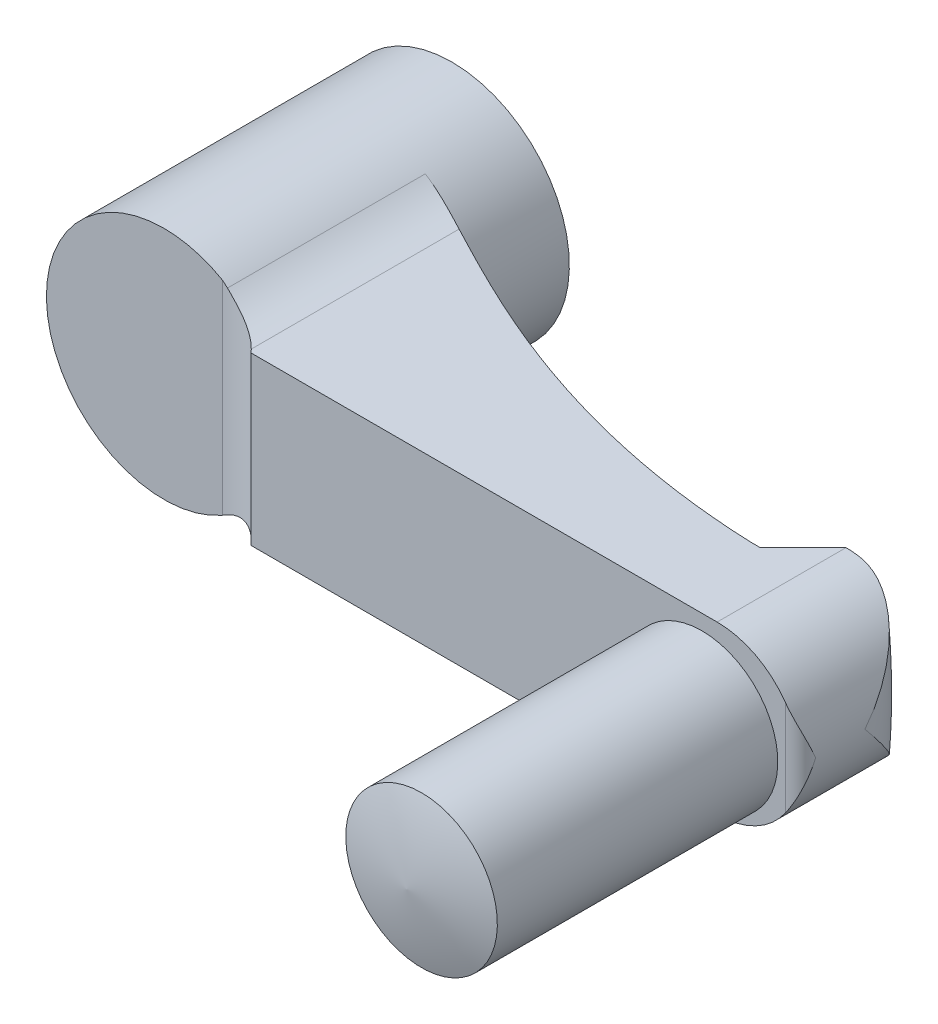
ISO-10303-21;
HEADER;
FILE_DESCRIPTION(('STEP AP214'),'2;1');
FILE_NAME('part.step','',(''),(''),'','','');
FILE_SCHEMA(('AUTOMOTIVE_DESIGN { 1 0 10303 214 1 1 1 1 }'));
ENDSEC;
DATA;
#1=APPLICATION_CONTEXT('core data for automotive mechanical design processes');
#2=APPLICATION_PROTOCOL_DEFINITION('international standard','automotive_design',2000,#1);
#3=PRODUCT_CONTEXT('',#1,'mechanical');
#4=PRODUCT('Part','Part','',(#3));
#5=PRODUCT_RELATED_PRODUCT_CATEGORY('part','',(#4));
#6=PRODUCT_DEFINITION_FORMATION('','',#4);
#7=PRODUCT_DEFINITION_CONTEXT('part definition',#1,'design');
#8=PRODUCT_DEFINITION('design','',#6,#7);
#9=PRODUCT_DEFINITION_SHAPE('','',#8);
#10=(LENGTH_UNIT() NAMED_UNIT(*) SI_UNIT(.MILLI.,.METRE.));
#11=(NAMED_UNIT(*) PLANE_ANGLE_UNIT() SI_UNIT($,.RADIAN.));
#12=(NAMED_UNIT(*) SI_UNIT($,.STERADIAN.) SOLID_ANGLE_UNIT());
#13=UNCERTAINTY_MEASURE_WITH_UNIT(LENGTH_MEASURE(1.E-05),#10,'distance_accuracy_value','');
#14=(GEOMETRIC_REPRESENTATION_CONTEXT(3) GLOBAL_UNCERTAINTY_ASSIGNED_CONTEXT((#13)) GLOBAL_UNIT_ASSIGNED_CONTEXT((#10,
#11,#12)) REPRESENTATION_CONTEXT('',''));
#15=CARTESIAN_POINT('',(0.,0.,0.));
#16=DIRECTION('',(0.,0.,1.));
#17=DIRECTION('',(1.,0.,0.));
#18=AXIS2_PLACEMENT_3D('',#15,#16,#17);
#19=CARTESIAN_POINT('',(7.75,0.,0.));
#20=DIRECTION('',(0.,0.,1.));
#21=DIRECTION('',(0.,-1.,0.));
#22=AXIS2_PLACEMENT_3D('',#19,#20,#21);
#23=PLANE('',#22);
#24=CARTESIAN_POINT('',(0.,0.,0.));
#25=DIRECTION('',(0.,0.,-1.));
#26=DIRECTION('',(0.,1.,0.));
#27=AXIS2_PLACEMENT_3D('',#24,#25,#26);
#28=CIRCLE('',#27,7.75);
#29=CARTESIAN_POINT('',(0.,7.75,0.));
#30=VERTEX_POINT('',#29);
#31=EDGE_CURVE('E360',#30,#30,#28,.T.);
#32=ORIENTED_EDGE('',*,*,#31,.T.);
#33=EDGE_LOOP('',(#32));
#34=FACE_BOUND('',#33,.T.);
#35=CARTESIAN_POINT('',(0.,0.,0.));
#36=DIRECTION('',(0.,0.,-1.));
#37=DIRECTION('',(0.,1.,0.));
#38=AXIS2_PLACEMENT_3D('',#35,#36,#37);
#39=CIRCLE('',#38,3.);
#40=CARTESIAN_POINT('',(0.,3.,0.));
#41=VERTEX_POINT('',#40);
#42=EDGE_CURVE('E605',#41,#41,#39,.T.);
#43=ORIENTED_EDGE('',*,*,#42,.F.);
#44=EDGE_LOOP('',(#43));
#45=FACE_BOUND('',#44,.T.);
#46=ADVANCED_FACE('F14',(#34,#45),#23,.F.);
#47=CARTESIAN_POINT('',(0.,0.,21.));
#48=DIRECTION('',(0.,0.,1.));
#49=DIRECTION('',(0.,-1.,0.));
#50=AXIS2_PLACEMENT_3D('',#47,#48,#49);
#51=PLANE('',#50);
#52=DIRECTION('',(1.,0.,0.));
#53=VECTOR('',#52,1.);
#54=CARTESIAN_POINT('',(7.53740671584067,5.5,21.));
#55=LINE('',#54,#53);
#56=CARTESIAN_POINT('',(7.75,5.5,21.));
#57=VERTEX_POINT('',#56);
#58=CARTESIAN_POINT('',(38.5,5.5,21.));
#59=VERTEX_POINT('',#58);
#60=EDGE_CURVE('E376',#57,#59,#55,.T.);
#61=ORIENTED_EDGE('',*,*,#60,.F.);
#62=DIRECTION('',(0.,1.,0.));
#63=VECTOR('',#62,1.);
#64=CARTESIAN_POINT('',(7.75,-11.,21.));
#65=LINE('',#64,#63);
#66=CARTESIAN_POINT('',(7.75,-5.5,21.));
#67=VERTEX_POINT('',#66);
#68=EDGE_CURVE('E392',#67,#57,#65,.T.);
#69=ORIENTED_EDGE('',*,*,#68,.F.);
#70=DIRECTION('',(-1.,0.,0.));
#71=VECTOR('',#70,1.);
#72=CARTESIAN_POINT('',(38.5,-5.5,21.));
#73=LINE('',#72,#71);
#74=CARTESIAN_POINT('',(38.5,-5.5,21.));
#75=VERTEX_POINT('',#74);
#76=EDGE_CURVE('E374',#75,#67,#73,.T.);
#77=ORIENTED_EDGE('',*,*,#76,.F.);
#78=CARTESIAN_POINT('',(38.5,0.,21.));
#79=DIRECTION('',(0.,0.,1.));
#80=DIRECTION('',(0.,-1.,0.));
#81=AXIS2_PLACEMENT_3D('',#78,#79,#80);
#82=CIRCLE('',#81,5.5);
#83=CARTESIAN_POINT('',(43.,-3.16227766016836,21.));
#84=VERTEX_POINT('',#83);
#85=EDGE_CURVE('E347',#75,#84,#82,.T.);
#86=ORIENTED_EDGE('',*,*,#85,.T.);
#87=DIRECTION('',(0.,1.,0.));
#88=VECTOR('',#87,1.);
#89=CARTESIAN_POINT('',(43.,-11.,21.));
#90=LINE('',#89,#88);
#91=CARTESIAN_POINT('',(43.,3.16227766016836,21.));
#92=VERTEX_POINT('',#91);
#93=EDGE_CURVE('E341',#84,#92,#90,.T.);
#94=ORIENTED_EDGE('',*,*,#93,.T.);
#95=EDGE_CURVE('E352',#92,#59,#82,.T.);
#96=ORIENTED_EDGE('',*,*,#95,.T.);
#97=EDGE_LOOP('',(#61,#69,#77,#86,#94,#96));
#98=FACE_BOUND('',#97,.T.);
#99=CARTESIAN_POINT('',(38.,0.,21.));
#100=DIRECTION('',(0.,0.,-1.));
#101=DIRECTION('',(0.,1.,0.));
#102=AXIS2_PLACEMENT_3D('',#99,#100,#101);
#103=CIRCLE('',#102,2.75);
#104=CARTESIAN_POINT('',(38.,2.75,21.));
#105=VERTEX_POINT('',#104);
#106=EDGE_CURVE('E609',#105,#105,#103,.T.);
#107=ORIENTED_EDGE('',*,*,#106,.T.);
#108=EDGE_LOOP('',(#107));
#109=FACE_BOUND('',#108,.T.);
#110=ADVANCED_FACE('F172',(#98,#109),#51,.T.);
#111=CARTESIAN_POINT('',(38.5,0.,0.));
#112=DIRECTION('',(0.,0.,1.));
#113=DIRECTION('',(0.,-1.,0.));
#114=AXIS2_PLACEMENT_3D('',#111,#112,#113);
#115=CYLINDRICAL_SURFACE('',#114,5.5);
#116=CARTESIAN_POINT('',(38.5,0.,12.5));
#117=DIRECTION('',(0.,0.,-1.));
#118=DIRECTION('',(0.,1.,0.));
#119=AXIS2_PLACEMENT_3D('',#116,#117,#118);
#120=CIRCLE('',#119,5.5);
#121=CARTESIAN_POINT('',(38.5,-5.5,12.5));
#122=VERTEX_POINT('',#121);
#123=CARTESIAN_POINT('',(39.377435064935,-5.42955870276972,12.5));
#124=VERTEX_POINT('',#123);
#125=EDGE_CURVE('E28',#122,#124,#120,.F.);
#126=ORIENTED_EDGE('',*,*,#125,.T.);
#127=CARTESIAN_POINT('',(44.0000000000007,0.,16.75));
#128=CARTESIAN_POINT('',(44.0000000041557,-0.00408243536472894,16.7466431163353));
#129=CARTESIAN_POINT('',(43.9999954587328,-0.00816498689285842,16.7432861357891));
#130=CARTESIAN_POINT('',(43.9991133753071,-0.404099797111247,16.4177186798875));
#131=CARTESIAN_POINT('',(43.9563241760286,-0.796947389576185,16.0946790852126));
#132=CARTESIAN_POINT('',(43.8283780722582,-1.37766302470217,15.6174093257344));
#133=CARTESIAN_POINT('',(43.7749481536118,-1.57014807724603,15.4592559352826));
#134=CARTESIAN_POINT('',(43.6463062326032,-1.9508542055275,15.1466423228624));
#135=CARTESIAN_POINT('',(43.5711042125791,-2.13907719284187,14.9921804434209));
#136=CARTESIAN_POINT('',(43.4186706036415,-2.4659958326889,14.7242247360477));
#137=CARTESIAN_POINT('',(43.3460564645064,-2.60594883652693,14.609622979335));
#138=CARTESIAN_POINT('',(43.1874974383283,-2.88143214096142,14.3843946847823));
#139=CARTESIAN_POINT('',(43.1015495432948,-3.01696143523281,14.2737690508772));
#140=CARTESIAN_POINT('',(42.8235332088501,-3.41489822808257,13.9497418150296));
#141=CARTESIAN_POINT('',(42.6109118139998,-3.66949006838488,13.7435033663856));
#142=CARTESIAN_POINT('',(42.1908137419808,-4.08554168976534,13.410621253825));
#143=CARTESIAN_POINT('',(41.9958616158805,-4.25419148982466,13.2770942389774));
#144=CARTESIAN_POINT('',(41.5745347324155,-4.56793366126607,13.0336120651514));
#145=CARTESIAN_POINT('',(41.3481930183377,-4.71305046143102,12.9236324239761));
#146=CARTESIAN_POINT('',(40.9167919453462,-4.94527718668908,12.7556440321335));
#147=CARTESIAN_POINT('',(40.7172696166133,-5.03816790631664,12.6915695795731));
#148=CARTESIAN_POINT('',(40.4067787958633,-5.16009443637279,12.6144630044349));
#149=CARTESIAN_POINT('',(40.3014902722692,-5.19781503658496,12.5919373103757));
#150=CARTESIAN_POINT('',(40.0876864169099,-5.26705387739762,12.5538382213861));
#151=CARTESIAN_POINT('',(39.9791725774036,-5.29857493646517,12.5382616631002));
#152=CARTESIAN_POINT('',(39.7583186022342,-5.35535128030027,12.5145546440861));
#153=CARTESIAN_POINT('',(39.6459483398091,-5.38052776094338,12.5065147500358));
#154=CARTESIAN_POINT('',(39.4195736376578,-5.4238055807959,12.4987921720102));
#155=CARTESIAN_POINT('',(39.3055694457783,-5.44190798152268,12.4991082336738));
#156=CARTESIAN_POINT('',(39.0758384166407,-5.47100698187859,12.5086269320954));
#157=CARTESIAN_POINT('',(38.960105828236,-5.48192973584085,12.5179195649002));
#158=CARTESIAN_POINT('',(38.7291969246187,-5.49645183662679,12.5458017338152));
#159=CARTESIAN_POINT('',(38.6140212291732,-5.50004434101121,12.56439993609));
#160=CARTESIAN_POINT('',(38.4998,-5.49999999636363,12.5877817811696));
#161=B_SPLINE_CURVE_WITH_KNOTS('',3,(#127,#128,#129,#130,#131,#132,#133,#134,#135,#136,#137,
#138,#139,#140,#141,#142,#143,#144,#145,#146,#147,#148,#149,#150,#151,#152,#153,#154,#155,#156,
#157,#158,#159,#160),.UNSPECIFIED.,.F.,.F.,(4,2,2,2,2,2,2,2,2,2,2,2,2,2,2,2,4),(0.,
0.0158565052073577,1.53775798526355,2.30146646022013,3.06482533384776,3.6490509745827,
4.23340860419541,5.39871924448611,6.26675444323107,7.13388271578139,7.81862458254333,
8.16052525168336,8.50227012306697,8.84807092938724,9.19381982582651,9.54307144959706,
9.89264893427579),.UNSPECIFIED.);
#162=CARTESIAN_POINT('',(44.,0.,16.75));
#163=VERTEX_POINT('',#162);
#164=EDGE_CURVE('E149',#124,#163,#161,.F.);
#165=ORIENTED_EDGE('',*,*,#164,.T.);
#166=CARTESIAN_POINT('',(44.0000000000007,0.,16.75));
#167=CARTESIAN_POINT('',(44.0000000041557,0.00408243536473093,16.7466431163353));
#168=CARTESIAN_POINT('',(43.9999954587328,0.0081649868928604,16.7432861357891));
#169=CARTESIAN_POINT('',(43.9991133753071,0.404099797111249,16.4177186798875));
#170=CARTESIAN_POINT('',(43.9563241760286,0.796947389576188,16.0946790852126));
#171=CARTESIAN_POINT('',(43.8283780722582,1.37766302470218,15.6174093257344));
#172=CARTESIAN_POINT('',(43.7749481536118,1.57014807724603,15.4592559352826));
#173=CARTESIAN_POINT('',(43.6463062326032,1.95085420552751,15.1466423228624));
#174=CARTESIAN_POINT('',(43.5711042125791,2.13907719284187,14.9921804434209));
#175=CARTESIAN_POINT('',(43.4186706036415,2.4659958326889,14.7242247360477));
#176=CARTESIAN_POINT('',(43.3460564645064,2.60594883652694,14.609622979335));
#177=CARTESIAN_POINT('',(43.1874974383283,2.88143214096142,14.3843946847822));
#178=CARTESIAN_POINT('',(43.1015495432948,3.01696143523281,14.2737690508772));
#179=CARTESIAN_POINT('',(42.8235332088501,3.41489822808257,13.9497418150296));
#180=CARTESIAN_POINT('',(42.6109118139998,3.66949006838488,13.7435033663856));
#181=CARTESIAN_POINT('',(42.1908137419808,4.08554168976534,13.410621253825));
#182=CARTESIAN_POINT('',(41.9958616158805,4.25419148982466,13.2770942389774));
#183=CARTESIAN_POINT('',(41.5745347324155,4.56793366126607,13.0336120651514));
#184=CARTESIAN_POINT('',(41.3481930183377,4.71305046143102,12.9236324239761));
#185=CARTESIAN_POINT('',(40.9167919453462,4.94527718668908,12.7556440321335));
#186=CARTESIAN_POINT('',(40.7172696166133,5.03816790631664,12.6915695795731));
#187=CARTESIAN_POINT('',(40.4067787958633,5.16009443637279,12.6144630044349));
#188=CARTESIAN_POINT('',(40.3014902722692,5.19781503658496,12.5919373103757));
#189=CARTESIAN_POINT('',(40.0876864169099,5.26705387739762,12.5538382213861));
#190=CARTESIAN_POINT('',(39.9791725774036,5.29857493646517,12.5382616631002));
#191=CARTESIAN_POINT('',(39.7583186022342,5.35535128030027,12.5145546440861));
#192=CARTESIAN_POINT('',(39.6459483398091,5.38052776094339,12.5065147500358));
#193=CARTESIAN_POINT('',(39.4195736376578,5.42380558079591,12.4987921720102));
#194=CARTESIAN_POINT('',(39.3055694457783,5.44190798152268,12.4991082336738));
#195=CARTESIAN_POINT('',(39.0758384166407,5.4710069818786,12.5086269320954));
#196=CARTESIAN_POINT('',(38.960105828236,5.48192973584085,12.5179195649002));
#197=CARTESIAN_POINT('',(38.7291969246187,5.49645183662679,12.5458017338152));
#198=CARTESIAN_POINT('',(38.6140212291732,5.50004434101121,12.56439993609));
#199=CARTESIAN_POINT('',(38.4998,5.49999999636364,12.5877817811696));
#200=B_SPLINE_CURVE_WITH_KNOTS('',3,(#166,#167,#168,#169,#170,#171,#172,#173,#174,#175,#176,
#177,#178,#179,#180,#181,#182,#183,#184,#185,#186,#187,#188,#189,#190,#191,#192,#193,#194,#195,
#196,#197,#198,#199),.UNSPECIFIED.,.F.,.F.,(4,2,2,2,2,2,2,2,2,2,2,2,2,2,2,2,4),(0.,
0.0158565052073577,1.53775798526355,2.30146646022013,3.06482533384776,3.64905097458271,
4.23340860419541,5.39871924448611,6.26675444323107,7.13388271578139,7.81862458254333,
8.16052525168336,8.50227012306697,8.84807092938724,9.19381982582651,9.54307144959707,
9.89264893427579),.UNSPECIFIED.);
#201=CARTESIAN_POINT('',(39.377435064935,5.42955870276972,12.5));
#202=VERTEX_POINT('',#201);
#203=EDGE_CURVE('E157',#163,#202,#200,.T.);
#204=ORIENTED_EDGE('',*,*,#203,.T.);
#205=CARTESIAN_POINT('',(38.5,5.5,12.5));
#206=VERTEX_POINT('',#205);
#207=EDGE_CURVE('E189',#202,#206,#120,.F.);
#208=ORIENTED_EDGE('',*,*,#207,.T.);
#209=DIRECTION('',(0.,0.,1.));
#210=VECTOR('',#209,1.);
#211=CARTESIAN_POINT('',(38.5,5.5,0.));
#212=LINE('',#211,#210);
#213=EDGE_CURVE('E367',#206,#59,#212,.T.);
#214=ORIENTED_EDGE('',*,*,#213,.T.);
#215=ORIENTED_EDGE('',*,*,#95,.F.);
#216=CARTESIAN_POINT('',(43.,3.16227766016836,21.));
#217=CARTESIAN_POINT('',(43.0489698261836,3.0926108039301,20.9999556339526));
#218=CARTESIAN_POINT('',(43.096252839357,3.02186876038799,20.9964077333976));
#219=CARTESIAN_POINT('',(43.187187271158,2.87878712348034,20.9834058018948));
#220=CARTESIAN_POINT('',(43.2308453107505,2.80645076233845,20.97396281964));
#221=CARTESIAN_POINT('',(43.3141980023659,2.6609204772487,20.9503365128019));
#222=CARTESIAN_POINT('',(43.3539154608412,2.58773460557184,20.936182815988));
#223=CARTESIAN_POINT('',(43.4296865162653,2.44030003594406,20.903917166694));
#224=CARTESIAN_POINT('',(43.4657377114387,2.36605067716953,20.8858026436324));
#225=CARTESIAN_POINT('',(43.5573559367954,2.16613298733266,20.8329178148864));
#226=CARTESIAN_POINT('',(43.6095944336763,2.0397138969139,20.7951786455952));
#227=CARTESIAN_POINT('',(43.7039555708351,1.78529411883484,20.7129945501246));
#228=CARTESIAN_POINT('',(43.7460735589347,1.65729273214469,20.6685465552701));
#229=CARTESIAN_POINT('',(43.8205857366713,1.3997829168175,20.5746664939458));
#230=CARTESIAN_POINT('',(43.8529463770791,1.2702708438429,20.5252179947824));
#231=CARTESIAN_POINT('',(43.9079882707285,1.0105810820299,20.4229956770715));
#232=CARTESIAN_POINT('',(43.9306732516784,0.880403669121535,20.3702231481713));
#233=CARTESIAN_POINT('',(43.9654953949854,0.627432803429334,20.2658240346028));
#234=CARTESIAN_POINT('',(43.9781829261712,0.504664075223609,20.214318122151));
#235=CARTESIAN_POINT('',(43.9952673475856,0.259135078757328,20.1104803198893));
#236=CARTESIAN_POINT('',(43.9996786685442,0.136375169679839,20.0581500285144));
#237=CARTESIAN_POINT('',(43.9999943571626,0.00909584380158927,20.0038784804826));
#238=CARTESIAN_POINT('',(43.9999999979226,0.00454789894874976,20.0019392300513));
#239=CARTESIAN_POINT('',(44.,0.,20.));
#240=B_SPLINE_CURVE_WITH_KNOTS('',3,(#216,#217,#218,#219,#220,#221,#222,#223,#224,#225,#226,
#227,#228,#229,#230,#231,#232,#233,#234,#235,#236,#237,#238,#239),.UNSPECIFIED.,.F.,.F.,(4,2,2,
2,2,2,2,2,2,2,2,4),(0.,0.255244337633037,0.510011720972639,0.763206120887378,1.01656533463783,
1.44159949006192,1.86682865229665,2.29350365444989,2.72001412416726,3.12097942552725,
3.52124493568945,3.53607734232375),.UNSPECIFIED.);
#241=CARTESIAN_POINT('',(44.,0.,20.));
#242=VERTEX_POINT('',#241);
#243=EDGE_CURVE('E183',#242,#92,#240,.F.);
#244=ORIENTED_EDGE('',*,*,#243,.F.);
#245=CARTESIAN_POINT('',(43.,-3.16227766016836,21.));
#246=CARTESIAN_POINT('',(43.0489698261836,-3.0926108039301,20.9999556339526));
#247=CARTESIAN_POINT('',(43.0962528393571,-3.02186876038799,20.9964077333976));
#248=CARTESIAN_POINT('',(43.187187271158,-2.87878712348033,20.9834058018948));
#249=CARTESIAN_POINT('',(43.2308453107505,-2.80645076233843,20.97396281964));
#250=CARTESIAN_POINT('',(43.3141980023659,-2.66092047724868,20.9503365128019));
#251=CARTESIAN_POINT('',(43.3539154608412,-2.58773460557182,20.936182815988));
#252=CARTESIAN_POINT('',(43.4296865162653,-2.44030003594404,20.903917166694));
#253=CARTESIAN_POINT('',(43.4657377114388,-2.36605067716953,20.8858026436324));
#254=CARTESIAN_POINT('',(43.5573559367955,-2.16613298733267,20.8329178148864));
#255=CARTESIAN_POINT('',(43.6095944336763,-2.0397138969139,20.7951786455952));
#256=CARTESIAN_POINT('',(43.7039555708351,-1.78529411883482,20.7129945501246));
#257=CARTESIAN_POINT('',(43.7460735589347,-1.65729273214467,20.6685465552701));
#258=CARTESIAN_POINT('',(43.8205857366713,-1.39978291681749,20.5746664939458));
#259=CARTESIAN_POINT('',(43.8529463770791,-1.27027084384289,20.5252179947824));
#260=CARTESIAN_POINT('',(43.9079882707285,-1.01058108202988,20.4229956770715));
#261=CARTESIAN_POINT('',(43.9306732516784,-0.880403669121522,20.3702231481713));
#262=CARTESIAN_POINT('',(43.9654953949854,-0.627432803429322,20.2658240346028));
#263=CARTESIAN_POINT('',(43.9781829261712,-0.504664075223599,20.214318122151));
#264=CARTESIAN_POINT('',(43.9952673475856,-0.259135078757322,20.1104803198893));
#265=CARTESIAN_POINT('',(43.9996786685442,-0.136375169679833,20.0581500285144));
#266=CARTESIAN_POINT('',(43.9999943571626,-0.00909584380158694,20.0038784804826));
#267=CARTESIAN_POINT('',(43.9999999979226,-0.00454789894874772,20.0019392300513));
#268=CARTESIAN_POINT('',(44.,0.,20.));
#269=B_SPLINE_CURVE_WITH_KNOTS('',3,(#245,#246,#247,#248,#249,#250,#251,#252,#253,#254,#255,
#256,#257,#258,#259,#260,#261,#262,#263,#264,#265,#266,#267,#268),.UNSPECIFIED.,.F.,.F.,(4,2,2,
2,2,2,2,2,2,2,2,4),(0.,0.255244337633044,0.510011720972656,0.763206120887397,1.01656533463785,
1.44159949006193,1.86682865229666,2.2935036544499,2.72001412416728,3.12097942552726,
3.52124493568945,3.53607734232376),.UNSPECIFIED.);
#270=EDGE_CURVE('E9',#84,#242,#269,.T.);
#271=ORIENTED_EDGE('',*,*,#270,.F.);
#272=ORIENTED_EDGE('',*,*,#85,.F.);
#273=DIRECTION('',(0.,0.,1.));
#274=VECTOR('',#273,1.);
#275=CARTESIAN_POINT('',(38.5,-5.5,0.));
#276=LINE('',#275,#274);
#277=EDGE_CURVE('E332',#122,#75,#276,.T.);
#278=ORIENTED_EDGE('',*,*,#277,.F.);
#279=EDGE_LOOP('',(#126,#165,#204,#208,#214,#215,#244,#271,#272,#278));
#280=FACE_BOUND('',#279,.T.);
#281=ADVANCED_FACE('F166',(#280),#115,.T.);
#282=CARTESIAN_POINT('',(37.5221379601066,-11.,-36.6335525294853));
#283=DIRECTION('',(0.,1.,0.));
#284=DIRECTION('',(-1.,0.,0.));
#285=AXIS2_PLACEMENT_3D('',#282,#283,#284);
#286=CYLINDRICAL_SURFACE('',#285,52.);
#287=CARTESIAN_POINT('',(37.5221379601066,-5.5,-36.6335525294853));
#288=DIRECTION('',(0.,1.,0.));
#289=DIRECTION('',(-1.,0.,0.));
#290=AXIS2_PLACEMENT_3D('',#287,#288,#289);
#291=CIRCLE('',#290,52.);
#292=CARTESIAN_POINT('',(35.6666666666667,-5.5,15.3333333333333));
#293=VERTEX_POINT('',#292);
#294=CARTESIAN_POINT('',(35.2565122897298,-5.5,15.3170676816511));
#295=VERTEX_POINT('',#294);
#296=EDGE_CURVE('E329',#293,#295,#291,.F.);
#297=ORIENTED_EDGE('',*,*,#296,.T.);
#298=CARTESIAN_POINT('',(35.0755586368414,-6.6002,15.3088602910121));
#299=CARTESIAN_POINT('',(35.1540680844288,-6.1630349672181,15.3125514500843));
#300=CARTESIAN_POINT('',(35.2249287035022,-5.72448880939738,15.3157172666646));
#301=CARTESIAN_POINT('',(35.3511277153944,-4.84515088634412,15.3211478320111));
#302=CARTESIAN_POINT('',(35.4064656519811,-4.40435905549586,15.3234125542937));
#303=CARTESIAN_POINT('',(35.5014094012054,-3.52089247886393,15.327191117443));
#304=CARTESIAN_POINT('',(35.5410088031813,-3.07821703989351,15.3287046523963));
#305=CARTESIAN_POINT('',(35.6042932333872,-2.1917545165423,15.3310780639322));
#306=CARTESIAN_POINT('',(35.6279785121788,-1.74796744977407,15.3319379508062));
#307=CARTESIAN_POINT('',(35.674607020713,-0.426881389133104,15.3336293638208));
#308=CARTESIAN_POINT('',(35.6743252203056,0.451348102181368,15.333616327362));
#309=CARTESIAN_POINT('',(35.6112446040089,2.20512558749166,15.3313339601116));
#310=CARTESIAN_POINT('',(35.5484753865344,3.08067465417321,15.3290656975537));
#311=CARTESIAN_POINT('',(35.4075498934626,4.39539879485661,15.3234549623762));
#312=CARTESIAN_POINT('',(35.3521949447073,4.83712845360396,15.321191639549));
#313=CARTESIAN_POINT('',(35.2256898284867,5.71976438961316,15.3157520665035));
#314=CARTESIAN_POINT('',(35.1544894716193,6.16066345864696,15.3125729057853));
#315=CARTESIAN_POINT('',(35.0755586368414,6.6002,15.3088602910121));
#316=B_SPLINE_CURVE_WITH_KNOTS('',3,(#298,#299,#300,#301,#302,#303,#304,#305,#306,#307,#308,
#309,#310,#311,#312,#313,#314,#315),.UNSPECIFIED.,.F.,.F.,(4,2,2,2,2,2,2,2,4),(0.,
1.33245731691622,2.66495379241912,3.99799246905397,5.33101015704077,7.963314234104,
10.5943720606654,11.9296974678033,13.2693142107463),.UNSPECIFIED.);
#317=CARTESIAN_POINT('',(35.6666666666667,0.,15.3333333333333));
#318=VERTEX_POINT('',#317);
#319=EDGE_CURVE('E299',#295,#318,#316,.T.);
#320=ORIENTED_EDGE('',*,*,#319,.T.);
#321=DIRECTION('',(0.,1.,0.));
#322=VECTOR('',#321,1.);
#323=CARTESIAN_POINT('',(35.6666666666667,-11.,15.3333333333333));
#324=LINE('',#323,#322);
#325=EDGE_CURVE('E265',#293,#318,#324,.T.);
#326=ORIENTED_EDGE('',*,*,#325,.F.);
#327=EDGE_LOOP('',(#297,#320,#326));
#328=FACE_BOUND('',#327,.T.);
#329=ADVANCED_FACE('F171',(#328),#286,.F.);
#330=CARTESIAN_POINT('',(35.6666666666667,5.5,15.3333333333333));
#331=VERTEX_POINT('',#330);
#332=EDGE_CURVE('E259',#318,#331,#324,.T.);
#333=ORIENTED_EDGE('',*,*,#332,.F.);
#334=CARTESIAN_POINT('',(35.2565122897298,5.5,15.3170676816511));
#335=VERTEX_POINT('',#334);
#336=EDGE_CURVE('E303',#318,#335,#316,.T.);
#337=ORIENTED_EDGE('',*,*,#336,.T.);
#338=CARTESIAN_POINT('',(37.5221379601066,5.5,-36.6335525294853));
#339=DIRECTION('',(0.,-1.,0.));
#340=DIRECTION('',(1.,0.,0.));
#341=AXIS2_PLACEMENT_3D('',#338,#339,#340);
#342=CIRCLE('',#341,52.);
#343=EDGE_CURVE('E379',#335,#331,#342,.F.);
#344=ORIENTED_EDGE('',*,*,#343,.T.);
#345=EDGE_LOOP('',(#333,#337,#344));
#346=FACE_BOUND('',#345,.T.);
#347=ADVANCED_FACE('F406',(#346),#286,.F.);
#348=CARTESIAN_POINT('',(39.75,-11.,12.5));
#349=DIRECTION('',(0.,0.,-1.));
#350=DIRECTION('',(0.,1.,0.));
#351=AXIS2_PLACEMENT_3D('',#348,#349,#350);
#352=PLANE('',#351);
#353=ORIENTED_EDGE('',*,*,#207,.F.);
#354=CARTESIAN_POINT('',(0.,0.,12.5));
#355=DIRECTION('',(0.,0.,-1.));
#356=DIRECTION('',(0.,1.,0.));
#357=AXIS2_PLACEMENT_3D('',#354,#355,#356);
#358=CIRCLE('',#357,39.75);
#359=EDGE_CURVE('E43',#202,#124,#358,.T.);
#360=ORIENTED_EDGE('',*,*,#359,.T.);
#361=ORIENTED_EDGE('',*,*,#125,.F.);
#362=DIRECTION('',(0.,1.,0.));
#363=VECTOR('',#362,1.);
#364=CARTESIAN_POINT('',(38.5,-11.,12.5));
#365=LINE('',#364,#363);
#366=EDGE_CURVE('E327',#122,#206,#365,.T.);
#367=ORIENTED_EDGE('',*,*,#366,.T.);
#368=EDGE_LOOP('',(#353,#360,#361,#367));
#369=FACE_BOUND('',#368,.T.);
#370=ADVANCED_FACE('F198',(#369),#352,.T.);
#371=CARTESIAN_POINT('',(0.,0.,0.));
#372=DIRECTION('',(0.,0.,-1.));
#373=DIRECTION('',(0.,1.,0.));
#374=AXIS2_PLACEMENT_3D('',#371,#372,#373);
#375=CYLINDRICAL_SURFACE('',#374,7.75);
#376=CARTESIAN_POINT('',(0.,0.,6.));
#377=DIRECTION('',(0.,0.,-1.));
#378=DIRECTION('',(0.,1.,0.));
#379=AXIS2_PLACEMENT_3D('',#376,#377,#378);
#380=CIRCLE('',#379,7.75);
#381=CARTESIAN_POINT('',(4.24835651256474,6.48181818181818,6.));
#382=VERTEX_POINT('',#381);
#383=CARTESIAN_POINT('',(4.24835651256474,-6.48181818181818,6.));
#384=VERTEX_POINT('',#383);
#385=EDGE_CURVE('E147',#382,#384,#380,.T.);
#386=ORIENTED_EDGE('',*,*,#385,.T.);
#387=DIRECTION('',(0.,0.,1.));
#388=VECTOR('',#387,1.);
#389=CARTESIAN_POINT('',(4.24835651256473,-6.48181818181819,0.));
#390=LINE('',#389,#388);
#391=CARTESIAN_POINT('',(4.24835651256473,-6.48181818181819,19.0510806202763));
#392=VERTEX_POINT('',#391);
#393=EDGE_CURVE('E372',#384,#392,#390,.T.);
#394=ORIENTED_EDGE('',*,*,#393,.T.);
#395=CARTESIAN_POINT('',(3.875,-6.7116968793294,19.));
#396=CARTESIAN_POINT('',(3.938490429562,-6.6750332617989,19.0066953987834));
#397=CARTESIAN_POINT('',(4.00134868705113,-6.63754489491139,19.0142998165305));
#398=CARTESIAN_POINT('',(4.1258008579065,-6.56091866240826,19.0313266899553));
#399=CARTESIAN_POINT('',(4.18739477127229,-6.52178079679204,19.0407491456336));
#400=CARTESIAN_POINT('',(4.24835651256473,-6.48181818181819,19.0510806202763));
#401=B_SPLINE_CURVE_WITH_KNOTS('',3,(#395,#396,#397,#398,#399,#400),.UNSPECIFIED.,.F.,.F.,(4,2,
4),(0.,0.220747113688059,0.441494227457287),.UNSPECIFIED.);
#402=CARTESIAN_POINT('',(3.875,-6.7116968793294,19.));
#403=VERTEX_POINT('',#402);
#404=EDGE_CURVE('E220',#403,#392,#401,.T.);
#405=ORIENTED_EDGE('',*,*,#404,.F.);
#406=CARTESIAN_POINT('',(0.,0.,19.));
#407=DIRECTION('',(0.,0.,-1.));
#408=DIRECTION('',(0.,1.,0.));
#409=AXIS2_PLACEMENT_3D('',#406,#407,#408);
#410=CIRCLE('',#409,7.75);
#411=CARTESIAN_POINT('',(3.875,6.7116968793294,19.));
#412=VERTEX_POINT('',#411);
#413=EDGE_CURVE('E356',#403,#412,#410,.T.);
#414=ORIENTED_EDGE('',*,*,#413,.T.);
#415=CARTESIAN_POINT('',(4.24835651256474,6.48181818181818,19.0510806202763));
#416=CARTESIAN_POINT('',(4.1873947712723,6.52178079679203,19.0407491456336));
#417=CARTESIAN_POINT('',(4.12580085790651,6.56091866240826,19.0313266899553));
#418=CARTESIAN_POINT('',(4.00134868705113,6.63754489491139,19.0142998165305));
#419=CARTESIAN_POINT('',(3.938490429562,6.67503326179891,19.0066953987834));
#420=CARTESIAN_POINT('',(3.875,6.71169687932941,19.));
#421=B_SPLINE_CURVE_WITH_KNOTS('',3,(#415,#416,#417,#418,#419,#420),.UNSPECIFIED.,.F.,.F.,(4,2,
4),(0.,0.220747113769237,0.441494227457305),.UNSPECIFIED.);
#422=CARTESIAN_POINT('',(4.24835651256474,6.48181818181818,19.0510806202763));
#423=VERTEX_POINT('',#422);
#424=EDGE_CURVE('E234',#423,#412,#421,.T.);
#425=ORIENTED_EDGE('',*,*,#424,.F.);
#426=DIRECTION('',(0.,0.,1.));
#427=VECTOR('',#426,1.);
#428=CARTESIAN_POINT('',(4.24835651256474,6.48181818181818,0.));
#429=LINE('',#428,#427);
#430=EDGE_CURVE('E363',#382,#423,#429,.T.);
#431=ORIENTED_EDGE('',*,*,#430,.F.);
#432=EDGE_LOOP('',(#386,#394,#405,#414,#425,#431));
#433=FACE_BOUND('',#432,.T.);
#434=ORIENTED_EDGE('',*,*,#31,.F.);
#435=EDGE_LOOP('',(#434));
#436=FACE_BOUND('',#435,.T.);
#437=ADVANCED_FACE('F245',(#433,#436),#375,.T.);
#438=CARTESIAN_POINT('',(7.53740671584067,11.5,0.));
#439=DIRECTION('',(0.,0.,1.));
#440=DIRECTION('',(0.,-1.,0.));
#441=AXIS2_PLACEMENT_3D('',#438,#439,#440);
#442=CYLINDRICAL_SURFACE('',#441,6.);
#443=DIRECTION('',(0.,0.,1.));
#444=VECTOR('',#443,1.);
#445=CARTESIAN_POINT('',(7.53740671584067,5.5,0.));
#446=LINE('',#445,#444);
#447=CARTESIAN_POINT('',(7.53740671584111,5.5,7.06134934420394));
#448=VERTEX_POINT('',#447);
#449=CARTESIAN_POINT('',(7.53740671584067,5.5,20.7710911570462));
#450=VERTEX_POINT('',#449);
#451=EDGE_CURVE('E365',#448,#450,#446,.T.);
#452=ORIENTED_EDGE('',*,*,#451,.F.);
#453=CARTESIAN_POINT('',(7.53760671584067,5.50000000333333,7.06145358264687));
#454=CARTESIAN_POINT('',(7.39944811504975,5.50001244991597,6.98948725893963));
#455=CARTESIAN_POINT('',(7.26049640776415,5.50476474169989,6.91892387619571));
#456=CARTESIAN_POINT('',(6.98097940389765,5.52420569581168,6.78178582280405));
#457=CARTESIAN_POINT('',(6.84041136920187,5.53891484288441,6.71521968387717));
#458=CARTESIAN_POINT('',(6.55624877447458,5.57900602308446,6.58668128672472));
#459=CARTESIAN_POINT('',(6.41263928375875,5.60453332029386,6.52478558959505));
#460=CARTESIAN_POINT('',(6.12498460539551,5.66675536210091,6.40846639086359));
#461=CARTESIAN_POINT('',(5.98093989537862,5.70344053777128,6.35403654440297));
#462=CARTESIAN_POINT('',(5.62308191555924,5.80922843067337,6.23054208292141));
#463=CARTESIAN_POINT('',(5.40922803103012,5.88542822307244,6.16713603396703));
#464=CARTESIAN_POINT('',(5.09281944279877,6.01939180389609,6.0933112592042));
#465=CARTESIAN_POINT('',(4.98837647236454,6.06715625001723,6.07228099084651));
#466=CARTESIAN_POINT('',(4.78142513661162,6.16916177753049,6.03791568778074));
#467=CARTESIAN_POINT('',(4.67891558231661,6.2233987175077,6.02457576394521));
#468=CARTESIAN_POINT('',(4.52196735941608,6.31239403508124,6.01025622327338));
#469=CARTESIAN_POINT('',(4.46654867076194,6.34500543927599,6.00641673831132));
#470=CARTESIAN_POINT('',(4.35661685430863,6.41209953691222,6.0012830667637));
#471=CARTESIAN_POINT('',(4.30210527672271,6.44658507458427,5.99999286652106));
#472=CARTESIAN_POINT('',(4.24815651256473,6.48194927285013,6.00000000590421));
#473=B_SPLINE_CURVE_WITH_KNOTS('',3,(#453,#454,#455,#456,#457,#458,#459,#460,#461,#462,#463,
#464,#465,#466,#467,#468,#469,#470,#471,#472),.UNSPECIFIED.,.F.,.F.,(4,2,2,2,2,2,2,2,2,4),(0.,
0.467334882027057,0.935634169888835,1.41043154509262,1.88482287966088,2.58871082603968,
2.93862271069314,3.28831189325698,3.48148696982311,3.67496387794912),.UNSPECIFIED.);
#474=EDGE_CURVE('E250',#448,#382,#473,.T.);
#475=ORIENTED_EDGE('',*,*,#474,.T.);
#476=ORIENTED_EDGE('',*,*,#430,.T.);
#477=CARTESIAN_POINT('',(7.53740671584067,5.5,20.7710911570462));
#478=CARTESIAN_POINT('',(7.44366157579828,5.49999370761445,20.6752511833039));
#479=CARTESIAN_POINT('',(7.34665333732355,5.50219706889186,20.5825569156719));
#480=CARTESIAN_POINT('',(7.14674160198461,5.51189651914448,20.403928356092));
#481=CARTESIAN_POINT('',(7.04383426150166,5.5193960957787,20.3179985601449));
#482=CARTESIAN_POINT('',(6.83271919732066,5.54057990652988,20.1533693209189));
#483=CARTESIAN_POINT('',(6.72450360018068,5.55427359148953,20.0746811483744));
#484=CARTESIAN_POINT('',(6.50384873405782,5.58863648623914,19.9251866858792));
#485=CARTESIAN_POINT('',(6.39141055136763,5.60930391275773,19.8543783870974));
#486=CARTESIAN_POINT('',(6.16275282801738,5.65841908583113,19.7206765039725));
#487=CARTESIAN_POINT('',(6.04651684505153,5.6869062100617,19.6578253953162));
#488=CARTESIAN_POINT('',(5.81204134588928,5.75213785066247,19.5407392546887));
#489=CARTESIAN_POINT('',(5.69380195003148,5.78888187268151,19.4865037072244));
#490=CARTESIAN_POINT('',(5.45691654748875,5.87085891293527,19.386857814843));
#491=CARTESIAN_POINT('',(5.33827219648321,5.91607135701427,19.341426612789));
#492=CARTESIAN_POINT('',(5.10168427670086,6.01513914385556,19.2591317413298));
#493=CARTESIAN_POINT('',(4.98374043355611,6.06899083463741,19.2222644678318));
#494=CARTESIAN_POINT('',(4.76152227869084,6.17944823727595,19.1600345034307));
#495=CARTESIAN_POINT('',(4.65706002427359,6.23524061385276,19.1338902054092));
#496=CARTESIAN_POINT('',(4.45063216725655,6.35354120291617,19.0878805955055));
#497=CARTESIAN_POINT('',(4.34866569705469,6.41604703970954,19.0680130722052));
#498=CARTESIAN_POINT('',(4.24835651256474,6.48181818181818,19.0510806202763));
#499=B_SPLINE_CURVE_WITH_KNOTS('',3,(#477,#478,#479,#480,#481,#482,#483,#484,#485,#486,#487,
#488,#489,#490,#491,#492,#493,#494,#495,#496,#497,#498),.UNSPECIFIED.,.F.,.F.,(4,2,2,2,2,2,2,2,
2,2,4),(0.,0.40215147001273,0.80456801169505,1.20760063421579,1.61053027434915,2.01552739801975,
2.42050028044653,2.82450174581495,3.22833287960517,3.59179833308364,3.95513558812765),.UNSPECIFIED.);
#500=EDGE_CURVE('E228',#450,#423,#499,.T.);
#501=ORIENTED_EDGE('',*,*,#500,.F.);
#502=EDGE_LOOP('',(#452,#475,#476,#501));
#503=FACE_BOUND('',#502,.T.);
#504=ADVANCED_FACE('F241',(#503),#442,.F.);
#505=CARTESIAN_POINT('',(7.53740671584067,5.5,0.));
#506=DIRECTION('',(0.,-1.,0.));
#507=DIRECTION('',(1.,0.,0.));
#508=AXIS2_PLACEMENT_3D('',#505,#506,#507);
#509=PLANE('',#508);
#510=CARTESIAN_POINT('',(4.71760222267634,5.5,43.7539134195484));
#511=CARTESIAN_POINT('',(4.86705016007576,5.5,43.6565880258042));
#512=CARTESIAN_POINT('',(5.01529220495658,5.5,43.5574370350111));
#513=CARTESIAN_POINT('',(5.30961860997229,5.5,43.3560198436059));
#514=CARTESIAN_POINT('',(5.45570325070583,5.5,43.2537540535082));
#515=CARTESIAN_POINT('',(5.745936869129,5.5,43.0466682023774));
#516=CARTESIAN_POINT('',(5.89008676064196,5.5,42.941849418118));
#517=CARTESIAN_POINT('',(6.17675418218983,5.5,42.7299954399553));
#518=CARTESIAN_POINT('',(6.31927165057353,5.5,42.6229601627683));
#519=CARTESIAN_POINT('',(6.74430286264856,5.5,42.2993212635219));
#520=CARTESIAN_POINT('',(7.02467843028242,5.5,42.079908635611));
#521=CARTESIAN_POINT('',(7.58101295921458,5.5,41.6355016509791));
#522=CARTESIAN_POINT('',(7.85697126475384,5.5,41.410506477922));
#523=CARTESIAN_POINT('',(8.40496287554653,5.5,40.9566001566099));
#524=CARTESIAN_POINT('',(8.67700132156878,5.5,40.7276952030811));
#525=CARTESIAN_POINT('',(9.2182448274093,5.5,40.266595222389));
#526=CARTESIAN_POINT('',(9.48745003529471,5.5,40.0344003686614));
#527=CARTESIAN_POINT('',(10.0236857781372,5.5,39.5672867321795));
#528=CARTESIAN_POINT('',(10.2907153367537,5.5,39.3323668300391));
#529=CARTESIAN_POINT('',(10.8228912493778,5.5,38.8603993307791));
#530=CARTESIAN_POINT('',(11.0880375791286,5.5,38.6233517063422));
#531=CARTESIAN_POINT('',(11.8746204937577,5.5,37.9154864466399));
#532=CARTESIAN_POINT('',(12.3937999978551,5.5,37.4421612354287));
#533=CARTESIAN_POINT('',(13.4278482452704,5.5,36.4908204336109));
#534=CARTESIAN_POINT('',(13.9427169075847,5.5,36.0128047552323));
#535=CARTESIAN_POINT('',(14.9692829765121,5.5,35.0533345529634));
#536=CARTESIAN_POINT('',(15.4809802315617,5.5,34.5718798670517));
#537=CARTESIAN_POINT('',(16.5019539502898,5.5,33.6064099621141));
#538=CARTESIAN_POINT('',(17.0112304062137,5.5,33.1223947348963));
#539=CARTESIAN_POINT('',(18.0278801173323,5.5,32.152419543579));
#540=CARTESIAN_POINT('',(18.535253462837,5.5,31.6664596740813));
#541=CARTESIAN_POINT('',(19.5485121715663,5.5,30.6929903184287));
#542=CARTESIAN_POINT('',(20.0543975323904,5.5,30.2054808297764));
#543=CARTESIAN_POINT('',(21.5702419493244,5.5,28.7411440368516));
#544=CARTESIAN_POINT('',(22.578422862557,5.5,27.7624763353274));
#545=CARTESIAN_POINT('',(24.5938880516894,5.5,25.7996570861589));
#546=CARTESIAN_POINT('',(25.6011651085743,5.5,24.8154981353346));
#547=CARTESIAN_POINT('',(27.6134625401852,5.5,22.8448607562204));
#548=CARTESIAN_POINT('',(28.6184828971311,5.5,21.8583823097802));
#549=CARTESIAN_POINT('',(30.6268292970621,5.5,19.8837798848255));
#550=CARTESIAN_POINT('',(31.6301554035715,5.5,18.8956559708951));
#551=CARTESIAN_POINT('',(33.6355586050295,5.5,16.9181413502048));
#552=CARTESIAN_POINT('',(34.6376356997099,5.5,15.9287506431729));
#553=CARTESIAN_POINT('',(36.8932939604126,5.5,13.699484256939));
#554=CARTESIAN_POINT('',(38.1466021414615,5.5,12.4593323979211));
#555=CARTESIAN_POINT('',(40.6520964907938,5.5,9.97789423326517));
#556=CARTESIAN_POINT('',(41.9042826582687,5.5,8.73660792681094));
#557=CARTESIAN_POINT('',(45.6596009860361,5.5,5.01143606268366));
#558=CARTESIAN_POINT('',(48.1614615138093,5.5,2.52626868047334));
#559=CARTESIAN_POINT('',(53.1550734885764,5.5,-2.43819270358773));
#560=CARTESIAN_POINT('',(55.6468316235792,5.5,-4.91747998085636));
#561=CARTESIAN_POINT('',(59.3834027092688,5.5,-8.63744540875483));
#562=CARTESIAN_POINT('',(60.6287396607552,5.5,-9.87759727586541));
#563=CARTESIAN_POINT('',(63.1191188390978,5.5,-12.3581966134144));
#564=CARTESIAN_POINT('',(64.3641610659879,5.5,-13.5986440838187));
#565=CARTESIAN_POINT('',(65.6090833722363,5.5,-14.8392118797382));
#566=B_SPLINE_CURVE_WITH_KNOTS('',3,(#510,#511,#512,#513,#514,#515,#516,#517,#518,#519,#520,
#521,#522,#523,#524,#525,#526,#527,#528,#529,#530,#531,#532,#533,#534,#535,#536,#537,#538,#539,
#540,#541,#542,#543,#544,#545,#546,#547,#548,#549,#550,#551,#552,#553,#554,#555,#556,#557,#558,
#559,#560,#561,#562,#563,#564,#565),.UNSPECIFIED.,.F.,.F.,(4,2,2,2,2,2,2,2,2,2,2,2,2,2,2,2,2,2,
2,2,2,2,2,2,2,2,2,4),(0.,0.535000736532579,1.06993126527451,1.60459955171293,2.13928796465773,
3.20724910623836,4.2753673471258,5.34192664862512,6.40842993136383,7.47538802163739,
8.54235982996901,10.6499782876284,12.7576362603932,14.8653941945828,16.9731588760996,
19.0808222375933,21.1884889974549,25.403683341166,29.6284373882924,33.8532246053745,
38.077849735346,42.302475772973,47.5919758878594,52.881479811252,63.4606204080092,
74.0058327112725,79.2783621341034,84.5508909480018),.UNSPECIFIED.);
#567=CARTESIAN_POINT('',(35.2400498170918,5.5,15.3333333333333));
#568=VERTEX_POINT('',#567);
#569=EDGE_CURVE('E35',#568,#335,#566,.T.);
#570=ORIENTED_EDGE('',*,*,#569,.F.);
#571=CARTESIAN_POINT('',(20.9124162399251,5.5,12.876404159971));
#572=CARTESIAN_POINT('',(19.9527373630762,5.5,12.5783643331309));
#573=CARTESIAN_POINT('',(19.000884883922,5.5,12.2552356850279));
#574=CARTESIAN_POINT('',(17.5860914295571,5.5,11.7353965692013));
#575=CARTESIAN_POINT('',(17.1166231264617,5.5,11.55624443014));
#576=CARTESIAN_POINT('',(16.1820932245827,5.5,11.1867688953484));
#577=CARTESIAN_POINT('',(15.7170316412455,5.5,10.9964454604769));
#578=CARTESIAN_POINT('',(14.7913864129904,5.5,10.6053094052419));
#579=CARTESIAN_POINT('',(14.3308024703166,5.5,10.4044974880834));
#580=CARTESIAN_POINT('',(13.4139647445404,5.5,9.99321621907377));
#581=CARTESIAN_POINT('',(12.957711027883,5.5,9.78274671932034));
#582=CARTESIAN_POINT('',(12.0492792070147,5.5,9.35326570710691));
#583=CARTESIAN_POINT('',(11.5971009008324,5.5,9.13425462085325));
#584=CARTESIAN_POINT('',(10.6962412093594,5.5,8.68917198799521));
#585=CARTESIAN_POINT('',(10.2475598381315,5.5,8.46310041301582));
#586=CARTESIAN_POINT('',(9.3465900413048,5.5,8.00281661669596));
#587=CARTESIAN_POINT('',(8.8943371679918,5.5,7.76853513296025));
#588=CARTESIAN_POINT('',(8.2166644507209,5.5,7.41570412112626));
#589=CARTESIAN_POINT('',(7.9908786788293,5.5,7.29785234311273));
#590=CARTESIAN_POINT('',(7.53924685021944,5.5,7.06226498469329));
#591=CARTESIAN_POINT('',(7.31340079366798,5.5,6.94452940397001));
#592=CARTESIAN_POINT('',(6.86070249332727,5.5,6.70958129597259));
#593=CARTESIAN_POINT('',(6.63384915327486,5.5,6.59237087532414));
#594=CARTESIAN_POINT('',(6.17923509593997,5.5,6.35969982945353));
#595=CARTESIAN_POINT('',(5.95147435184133,5.5,6.24423925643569));
#596=CARTESIAN_POINT('',(5.49452133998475,5.5,6.01630541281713));
#597=CARTESIAN_POINT('',(5.26532941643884,5.5,5.90383145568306));
#598=CARTESIAN_POINT('',(4.80476765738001,5.5,5.68345110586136));
#599=CARTESIAN_POINT('',(4.57339798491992,5.5,5.57554437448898));
#600=CARTESIAN_POINT('',(4.09198600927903,5.5,5.35938929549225));
#601=CARTESIAN_POINT('',(3.84173328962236,5.5,5.25160477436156));
#602=CARTESIAN_POINT('',(3.33662574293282,5.5,5.04709924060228));
#603=CARTESIAN_POINT('',(3.08177005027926,5.5,4.95038033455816));
#604=CARTESIAN_POINT('',(2.56786332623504,5.5,4.77309090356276));
#605=CARTESIAN_POINT('',(2.30884049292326,5.5,4.69244015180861));
#606=CARTESIAN_POINT('',(1.78509119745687,5.5,4.55230591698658));
#607=CARTESIAN_POINT('',(1.52036776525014,5.5,4.49281146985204));
#608=CARTESIAN_POINT('',(1.03941604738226,5.5,4.40988547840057));
#609=CARTESIAN_POINT('',(0.824030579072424,5.5,4.38163127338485));
#610=CARTESIAN_POINT('',(0.391583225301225,5.5,4.34457865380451));
#611=CARTESIAN_POINT('',(0.17452166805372,5.5,4.33577652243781));
#612=CARTESIAN_POINT('',(-0.259266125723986,5.5,4.33839332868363));
#613=CARTESIAN_POINT('',(-0.475992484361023,5.5,4.34979292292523));
#614=CARTESIAN_POINT('',(-0.907552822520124,5.5,4.39178651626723));
#615=CARTESIAN_POINT('',(-1.12238660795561,5.5,4.42238246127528));
#616=CARTESIAN_POINT('',(-1.54147307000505,5.5,4.49905185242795));
#617=CARTESIAN_POINT('',(-1.74583367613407,5.5,4.54454914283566));
#618=CARTESIAN_POINT('',(-2.151246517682,5.5,4.6485913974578));
#619=CARTESIAN_POINT('',(-2.3522972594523,5.5,4.70714208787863));
#620=CARTESIAN_POINT('',(-2.75140058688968,5.5,4.83475788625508));
#621=CARTESIAN_POINT('',(-2.94944689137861,5.5,4.90384237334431));
#622=CARTESIAN_POINT('',(-3.34247529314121,5.5,5.05009570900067));
#623=CARTESIAN_POINT('',(-3.53745772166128,5.5,5.12726367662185));
#624=CARTESIAN_POINT('',(-3.92773161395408,5.5,5.28894484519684));
#625=CARTESIAN_POINT('',(-4.12298461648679,5.5,5.37355015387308));
#626=CARTESIAN_POINT('',(-4.51136611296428,5.5,5.54747721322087));
#627=CARTESIAN_POINT('',(-4.70449459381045,5.5,5.63679899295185));
#628=CARTESIAN_POINT('',(-5.08894562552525,5.5,5.81879992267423));
#629=CARTESIAN_POINT('',(-5.2802696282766,5.5,5.91147601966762));
#630=CARTESIAN_POINT('',(-5.56635262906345,5.5,6.05231531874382));
#631=CARTESIAN_POINT('',(-5.66156329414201,5.5,6.09956602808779));
#632=CARTESIAN_POINT('',(-5.85173074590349,5.5,6.19457454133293));
#633=CARTESIAN_POINT('',(-5.94668753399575,5.5,6.24233234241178));
#634=CARTESIAN_POINT('',(-6.26062658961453,5.5,6.40107734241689));
#635=CARTESIAN_POINT('',(-6.47915881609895,5.5,6.51295372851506));
#636=CARTESIAN_POINT('',(-6.91558968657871,5.5,6.73793554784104));
#637=CARTESIAN_POINT('',(-7.13348832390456,5.5,6.85104099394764));
#638=CARTESIAN_POINT('',(-7.56903891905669,5.5,7.07774545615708));
#639=CARTESIAN_POINT('',(-7.78669086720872,5.5,7.19134449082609));
#640=CARTESIAN_POINT('',(-8.22204194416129,5.5,7.41845201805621));
#641=CARTESIAN_POINT('',(-8.43974107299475,5.5,7.53196051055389));
#642=CARTESIAN_POINT('',(-9.09329542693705,5.5,7.8716327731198));
#643=CARTESIAN_POINT('',(-9.52959884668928,5.5,8.09693871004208));
#644=CARTESIAN_POINT('',(-10.4047816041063,5.5,8.54249489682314));
#645=CARTESIAN_POINT('',(-10.8436608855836,5.5,8.76274525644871));
#646=CARTESIAN_POINT('',(-11.5044308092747,5.5,9.08789531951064));
#647=CARTESIAN_POINT('',(-11.7250475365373,5.5,9.19538487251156));
#648=CARTESIAN_POINT('',(-12.1671958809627,5.5,9.40846437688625));
#649=CARTESIAN_POINT('',(-12.3887274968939,5.5,9.51405433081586));
#650=CARTESIAN_POINT('',(-13.0547828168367,5.5,9.82773290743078));
#651=CARTESIAN_POINT('',(-13.5007687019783,5.5,10.0327310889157));
#652=CARTESIAN_POINT('',(-14.3969208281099,5.5,10.4334738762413));
#653=CARTESIAN_POINT('',(-14.8470873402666,5.5,10.6292178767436));
#654=CARTESIAN_POINT('',(-15.7516568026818,5.5,11.0106654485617));
#655=CARTESIAN_POINT('',(-16.2060598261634,5.5,11.1963688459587));
#656=CARTESIAN_POINT('',(-17.5636761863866,5.5,11.7327401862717));
#657=CARTESIAN_POINT('',(-18.4730655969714,5.5,12.0679635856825));
#658=CARTESIAN_POINT('',(-20.3072517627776,5.5,12.6932163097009));
#659=CARTESIAN_POINT('',(-21.2320484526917,5.5,12.9832458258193));
#660=CARTESIAN_POINT('',(-23.0961840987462,5.5,13.5159179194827));
#661=CARTESIAN_POINT('',(-24.0355362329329,5.5,13.7585144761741));
#662=CARTESIAN_POINT('',(-25.9257611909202,5.5,14.1941477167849));
#663=CARTESIAN_POINT('',(-26.876634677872,5.5,14.3871815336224));
#664=CARTESIAN_POINT('',(-28.564999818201,5.5,14.683322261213));
#665=CARTESIAN_POINT('',(-29.3006713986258,5.5,14.7969025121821));
#666=CARTESIAN_POINT('',(-30.7760702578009,5.5,14.9936116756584));
#667=CARTESIAN_POINT('',(-31.51579742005,5.5,15.0767414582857));
#668=CARTESIAN_POINT('',(-32.9976298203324,5.5,15.2121492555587));
#669=CARTESIAN_POINT('',(-33.7397333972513,5.5,15.2644454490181));
#670=CARTESIAN_POINT('',(-35.2254922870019,5.5,15.3380021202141));
#671=CARTESIAN_POINT('',(-35.9691476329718,5.5,15.3592619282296));
#672=CARTESIAN_POINT('',(-37.4613792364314,5.5,15.3705989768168));
#673=CARTESIAN_POINT('',(-38.2099570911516,5.5,15.3604797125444));
#674=CARTESIAN_POINT('',(-39.7060308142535,5.5,15.3085429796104));
#675=CARTESIAN_POINT('',(-40.4535265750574,5.5,15.2667225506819));
#676=CARTESIAN_POINT('',(-42.692523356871,5.5,15.0936179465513));
#677=CARTESIAN_POINT('',(-44.180640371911,5.5,14.9146912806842));
#678=CARTESIAN_POINT('',(-47.1341991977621,5.5,14.4308281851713));
#679=CARTESIAN_POINT('',(-48.5996662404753,5.5,14.1260443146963));
#680=CARTESIAN_POINT('',(-51.4991601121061,5.5,13.392321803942));
#681=CARTESIAN_POINT('',(-52.9331887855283,5.5,12.9633904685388));
#682=CARTESIAN_POINT('',(-55.7562861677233,5.5,11.9852455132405));
#683=CARTESIAN_POINT('',(-57.1454416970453,5.5,11.436282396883));
#684=CARTESIAN_POINT('',(-59.8716479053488,5.5,10.2213764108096));
#685=CARTESIAN_POINT('',(-61.2086983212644,5.5,9.55543295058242));
#686=CARTESIAN_POINT('',(-63.8019060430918,5.5,8.12174778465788));
#687=CARTESIAN_POINT('',(-65.0589518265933,5.5,7.35561254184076));
#688=CARTESIAN_POINT('',(-67.5036974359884,5.5,5.71972752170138));
#689=CARTESIAN_POINT('',(-68.6913982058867,5.5,4.84997915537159));
#690=CARTESIAN_POINT('',(-70.9895404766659,5.5,3.01249854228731));
#691=CARTESIAN_POINT('',(-72.0999371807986,5.5,2.04471026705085));
#692=CARTESIAN_POINT('',(-74.2346807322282,5.5,0.0184690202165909));
#693=CARTESIAN_POINT('',(-75.2590275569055,5.5,-1.03998397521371));
#694=CARTESIAN_POINT('',(-77.2088598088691,5.5,-3.23391108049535));
#695=CARTESIAN_POINT('',(-78.1348581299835,5.5,-4.36892941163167));
#696=CARTESIAN_POINT('',(-79.8877577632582,5.5,-6.71306452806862));
#697=CARTESIAN_POINT('',(-80.7146595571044,5.5,-7.92218095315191));
#698=CARTESIAN_POINT('',(-82.2633021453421,5.5,-10.4056954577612));
#699=CARTESIAN_POINT('',(-82.9850608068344,5.5,-11.6800823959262));
#700=CARTESIAN_POINT('',(-84.3184049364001,5.5,-14.2852453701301));
#701=CARTESIAN_POINT('',(-84.9299904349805,5.5,-15.6160213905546));
#702=CARTESIAN_POINT('',(-86.0375394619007,5.5,-18.3218821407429));
#703=CARTESIAN_POINT('',(-86.5337212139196,5.5,-19.6968775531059));
#704=CARTESIAN_POINT('',(-87.408407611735,5.5,-22.4838007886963));
#705=CARTESIAN_POINT('',(-87.7869124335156,5.5,-23.8957285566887));
#706=CARTESIAN_POINT('',(-88.4235482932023,5.5,-26.746517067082));
#707=CARTESIAN_POINT('',(-88.6816752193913,5.5,-28.1853787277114));
#708=CARTESIAN_POINT('',(-89.0756891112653,5.5,-31.0797431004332));
#709=CARTESIAN_POINT('',(-89.2115760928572,5.5,-32.5352458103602));
#710=CARTESIAN_POINT('',(-89.3600800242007,5.5,-35.4513914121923));
#711=CARTESIAN_POINT('',(-89.3727926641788,5.5,-36.9120294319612));
#712=CARTESIAN_POINT('',(-89.2751064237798,5.5,-39.8291821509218));
#713=CARTESIAN_POINT('',(-89.164707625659,5.5,-41.2856968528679));
#714=CARTESIAN_POINT('',(-88.8215890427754,5.5,-44.1842321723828));
#715=CARTESIAN_POINT('',(-88.5888704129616,5.5,-45.6262529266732));
#716=CARTESIAN_POINT('',(-88.0027755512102,5.5,-48.4855622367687));
#717=CARTESIAN_POINT('',(-87.6493993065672,5.5,-49.9028507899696));
#718=CARTESIAN_POINT('',(-86.8245561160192,5.5,-52.7024788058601));
#719=CARTESIAN_POINT('',(-86.3531012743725,5.5,-54.0848218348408));
#720=CARTESIAN_POINT('',(-85.2954499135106,5.5,-56.8048916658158));
#721=CARTESIAN_POINT('',(-84.7092534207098,5.5,-58.1426184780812));
#722=CARTESIAN_POINT('',(-83.4263056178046,5.5,-60.7639597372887));
#723=CARTESIAN_POINT('',(-82.7295545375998,5.5,-62.0475742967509));
#724=CARTESIAN_POINT('',(-81.2304702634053,5.5,-64.5515938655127));
#725=CARTESIAN_POINT('',(-80.428137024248,5.5,-65.771998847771));
#726=CARTESIAN_POINT('',(-78.7232118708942,5.5,-68.1415171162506));
#727=CARTESIAN_POINT('',(-77.8205728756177,5.5,-69.2905965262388));
#728=CARTESIAN_POINT('',(-75.9217889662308,5.5,-71.5087086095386));
#729=CARTESIAN_POINT('',(-74.9256440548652,5.5,-72.5777412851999));
#730=CARTESIAN_POINT('',(-72.8469373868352,5.5,-74.6282363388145));
#731=CARTESIAN_POINT('',(-71.7643740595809,5.5,-75.6096971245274));
#732=CARTESIAN_POINT('',(-69.5205653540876,5.5,-77.4781271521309));
#733=CARTESIAN_POINT('',(-68.3593198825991,5.5,-78.3650962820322));
#734=CARTESIAN_POINT('',(-65.9647242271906,5.5,-80.0395241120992));
#735=CARTESIAN_POINT('',(-64.7312742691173,5.5,-80.8268401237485));
#736=CARTESIAN_POINT('',(-62.2025681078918,5.5,-82.2950101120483));
#737=CARTESIAN_POINT('',(-60.9073119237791,5.5,-82.9758641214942));
#738=CARTESIAN_POINT('',(-58.2643462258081,5.5,-84.2263682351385));
#739=CARTESIAN_POINT('',(-56.9166418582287,5.5,-84.7960292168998));
#740=CARTESIAN_POINT('',(-54.1782373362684,5.5,-85.8203943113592));
#741=CARTESIAN_POINT('',(-52.7875370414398,5.5,-86.2750980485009));
#742=CARTESIAN_POINT('',(-49.968321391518,5.5,-87.0679020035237));
#743=CARTESIAN_POINT('',(-48.5396963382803,5.5,-87.4056122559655));
#744=CARTESIAN_POINT('',(-45.6592670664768,5.5,-87.9603031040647));
#745=CARTESIAN_POINT('',(-44.2074629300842,5.5,-88.1772841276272));
#746=CARTESIAN_POINT('',(-41.2901110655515,5.5,-88.4895243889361));
#747=CARTESIAN_POINT('',(-39.8245585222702,5.5,-88.5847392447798));
#748=CARTESIAN_POINT('',(-37.6244549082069,5.5,-88.6362066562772));
#749=CARTESIAN_POINT('',(-36.890692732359,5.5,-88.6381307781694));
#750=CARTESIAN_POINT('',(-35.4237324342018,5.5,-88.6116533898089));
#751=CARTESIAN_POINT('',(-34.6905342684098,5.5,-88.5832545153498));
#752=CARTESIAN_POINT('',(-33.2178967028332,5.5,-88.4958378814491));
#753=CARTESIAN_POINT('',(-32.4784772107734,5.5,-88.4364872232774));
#754=CARTESIAN_POINT('',(-31.0027868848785,5.5,-88.2872697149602));
#755=CARTESIAN_POINT('',(-30.2665157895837,5.5,-88.1974054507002));
#756=CARTESIAN_POINT('',(-28.7982366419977,5.5,-87.9875311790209));
#757=CARTESIAN_POINT('',(-28.0662288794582,5.5,-87.8675191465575));
#758=CARTESIAN_POINT('',(-26.6077603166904,5.5,-87.5978528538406));
#759=CARTESIAN_POINT('',(-25.8812990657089,5.5,-87.4482010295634));
#760=CARTESIAN_POINT('',(-24.4362803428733,5.5,-87.120164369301));
#761=CARTESIAN_POINT('',(-23.7177109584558,5.5,-86.9418319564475));
#762=CARTESIAN_POINT('',(-22.2882087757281,5.5,-86.5570271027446));
#763=CARTESIAN_POINT('',(-21.5772754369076,5.5,-86.3505566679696));
#764=CARTESIAN_POINT('',(-20.1639393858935,5.5,-85.9104589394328));
#765=CARTESIAN_POINT('',(-19.4615360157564,5.5,-85.6768337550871));
#766=CARTESIAN_POINT('',(-18.0659246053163,5.5,-85.183656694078));
#767=CARTESIAN_POINT('',(-17.3727162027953,5.5,-84.9241058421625));
#768=CARTESIAN_POINT('',(-16.2553880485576,5.5,-84.4831389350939));
#769=CARTESIAN_POINT('',(-15.8283188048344,5.5,-84.3091427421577));
#770=CARTESIAN_POINT('',(-14.9779213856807,5.5,-83.9522413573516));
#771=CARTESIAN_POINT('',(-14.5545931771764,5.5,-83.7693362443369));
#772=CARTESIAN_POINT('',(-13.7117107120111,5.5,-83.395288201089));
#773=CARTESIAN_POINT('',(-13.292155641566,5.5,-83.2041471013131));
#774=CARTESIAN_POINT('',(-12.4565346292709,5.5,-82.8143880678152));
#775=CARTESIAN_POINT('',(-12.040468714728,5.5,-82.615770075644));
#776=CARTESIAN_POINT('',(-11.210936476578,5.5,-82.2118377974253));
#777=CARTESIAN_POINT('',(-10.7974742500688,5.5,-82.0065151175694));
#778=CARTESIAN_POINT('',(-9.97308946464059,5.5,-81.5908305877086));
#779=CARTESIAN_POINT('',(-9.56216695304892,5.5,-81.3804686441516));
#780=CARTESIAN_POINT('',(-8.74192421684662,5.5,-80.9566707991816));
#781=CARTESIAN_POINT('',(-8.33260397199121,5.5,-80.7432349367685));
#782=CARTESIAN_POINT('',(-7.71868502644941,5.5,-80.4229706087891));
#783=CARTESIAN_POINT('',(-7.51405656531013,5.5,-80.3161979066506));
#784=CARTESIAN_POINT('',(-7.10455231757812,5.5,-80.1031271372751));
#785=CARTESIAN_POINT('',(-6.89967653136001,5.5,-79.9968290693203));
#786=CARTESIAN_POINT('',(-6.52543006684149,5.5,-79.8039187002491));
#787=CARTESIAN_POINT('',(-6.35614991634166,5.5,-79.7171310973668));
#788=CARTESIAN_POINT('',(-6.01698926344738,5.5,-79.5447319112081));
#789=CARTESIAN_POINT('',(-5.84710875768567,5.5,-79.459120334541));
#790=CARTESIAN_POINT('',(-5.5064386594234,5.5,-79.2895718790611));
#791=CARTESIAN_POINT('',(-5.33564877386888,5.5,-79.2056355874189));
#792=CARTESIAN_POINT('',(-4.99292800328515,5.5,-79.04012065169));
#793=CARTESIAN_POINT('',(-4.8209971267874,5.5,-78.9585419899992));
#794=CARTESIAN_POINT('',(-4.47566653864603,5.5,-78.7985503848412));
#795=CARTESIAN_POINT('',(-4.30226685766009,5.5,-78.7201373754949));
#796=CARTESIAN_POINT('',(-3.95362499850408,5.5,-78.5674722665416));
#797=CARTESIAN_POINT('',(-3.77838272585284,5.5,-78.4932203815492));
#798=CARTESIAN_POINT('',(-3.42577879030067,5.5,-78.3501518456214));
#799=CARTESIAN_POINT('',(-3.2484182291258,5.5,-78.28133249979));
#800=CARTESIAN_POINT('',(-2.89118257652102,5.5,-78.1506012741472));
#801=CARTESIAN_POINT('',(-2.71130787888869,5.5,-78.0886883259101));
#802=CARTESIAN_POINT('',(-2.3091881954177,5.5,-77.9609446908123));
#803=CARTESIAN_POINT('',(-2.08626619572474,5.5,-77.8972095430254));
#804=CARTESIAN_POINT('',(-1.6362787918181,5.5,-77.7862109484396));
#805=CARTESIAN_POINT('',(-1.40921416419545,5.5,-77.7389444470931));
#806=CARTESIAN_POINT('',(-1.06704624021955,5.5,-77.683163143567));
#807=CARTESIAN_POINT('',(-0.953147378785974,5.5,-77.667120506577));
#808=CARTESIAN_POINT('',(-0.724729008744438,5.5,-77.6402878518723));
#809=CARTESIAN_POINT('',(-0.61020952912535,5.5,-77.6294975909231));
#810=CARTESIAN_POINT('',(-0.380797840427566,5.5,-77.613427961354));
#811=CARTESIAN_POINT('',(-0.265905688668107,5.5,-77.6081477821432));
#812=CARTESIAN_POINT('',(-0.0359891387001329,5.5,-77.6032142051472));
#813=CARTESIAN_POINT('',(0.0790352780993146,5.5,-77.6035617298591));
#814=CARTESIAN_POINT('',(0.424245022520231,5.5,-77.6130918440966));
#815=CARTESIAN_POINT('',(0.654243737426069,5.5,-77.630784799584));
#816=CARTESIAN_POINT('',(1.11164166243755,5.5,-77.6872256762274));
#817=CARTESIAN_POINT('',(1.33903981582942,5.5,-77.7259818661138));
#818=CARTESIAN_POINT('',(1.67822537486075,5.5,-77.7977140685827));
#819=CARTESIAN_POINT('',(1.79147805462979,5.5,-77.824042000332));
#820=CARTESIAN_POINT('',(2.01691978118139,5.5,-77.8807707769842));
#821=CARTESIAN_POINT('',(2.12910919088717,5.5,-77.9111701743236));
#822=CARTESIAN_POINT('',(2.35243523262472,5.5,-77.9755907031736));
#823=CARTESIAN_POINT('',(2.46357187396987,5.5,-78.0096118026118));
#824=CARTESIAN_POINT('',(2.6848175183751,5.5,-78.0808378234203));
#825=CARTESIAN_POINT('',(2.79492650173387,5.5,-78.1180428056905));
#826=CARTESIAN_POINT('',(3.13693754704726,5.5,-78.238436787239));
#827=CARTESIAN_POINT('',(3.36714018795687,5.5,-78.3264618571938));
#828=CARTESIAN_POINT('',(3.8238889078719,5.5,-78.5115847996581));
#829=CARTESIAN_POINT('',(4.05043378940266,5.5,-78.6086855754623));
#830=CARTESIAN_POINT('',(4.50087487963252,5.5,-78.8094511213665));
#831=CARTESIAN_POINT('',(4.72476790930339,5.5,-78.9131229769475));
#832=CARTESIAN_POINT('',(5.17038428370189,5.5,-79.1249345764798));
#833=CARTESIAN_POINT('',(5.39210786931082,5.5,-79.2330738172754));
#834=CARTESIAN_POINT('',(5.8347915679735,5.5,-79.4526869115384));
#835=CARTESIAN_POINT('',(6.05574683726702,5.5,-79.5641704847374));
#836=CARTESIAN_POINT('',(6.49671935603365,5.5,-79.7889818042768));
#837=CARTESIAN_POINT('',(6.71673658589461,5.5,-79.9023095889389));
#838=CARTESIAN_POINT('',(7.15614162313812,5.5,-80.1298469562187));
#839=CARTESIAN_POINT('',(7.37552973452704,5.5,-80.2440559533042));
#840=CARTESIAN_POINT('',(7.81416840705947,5.5,-80.4727380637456));
#841=CARTESIAN_POINT('',(8.03341896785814,5.5,-80.5872111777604));
#842=CARTESIAN_POINT('',(8.69234268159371,5.5,-80.9306636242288));
#843=CARTESIAN_POINT('',(9.13225546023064,5.5,-81.15918677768));
#844=CARTESIAN_POINT('',(10.014422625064,5.5,-81.6118327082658));
#845=CARTESIAN_POINT('',(10.4566773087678,5.5,-81.8359549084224));
#846=CARTESIAN_POINT('',(11.3437939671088,5.5,-82.2773137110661));
#847=CARTESIAN_POINT('',(11.788651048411,5.5,-82.4945601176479));
#848=CARTESIAN_POINT('',(12.6822182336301,5.5,-82.9210004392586));
#849=CARTESIAN_POINT('',(13.1309283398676,5.5,-83.1301943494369));
#850=CARTESIAN_POINT('',(13.9689071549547,5.5,-83.5105416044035));
#851=CARTESIAN_POINT('',(14.3576294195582,5.5,-83.6828975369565));
#852=CARTESIAN_POINT('',(15.1382340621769,5.5,-84.020299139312));
#853=CARTESIAN_POINT('',(15.5301164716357,5.5,-84.1853447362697));
#854=CARTESIAN_POINT('',(16.7105768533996,5.5,-84.6688329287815));
#855=CARTESIAN_POINT('',(17.5039741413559,5.5,-84.9756297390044));
#856=CARTESIAN_POINT('',(19.1034737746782,5.5,-85.5555344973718));
#857=CARTESIAN_POINT('',(19.9095827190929,5.5,-85.828624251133));
#858=CARTESIAN_POINT('',(21.5330642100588,5.5,-86.3389775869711));
#859=CARTESIAN_POINT('',(22.3504364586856,5.5,-86.5762421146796));
#860=CARTESIAN_POINT('',(23.9984797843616,5.5,-87.0143682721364));
#861=CARTESIAN_POINT('',(24.8291916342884,5.5,-87.2150767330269));
#862=CARTESIAN_POINT('',(26.4990458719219,5.5,-87.5777456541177));
#863=CARTESIAN_POINT('',(27.33818830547,5.5,-87.7397059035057));
#864=CARTESIAN_POINT('',(29.0231744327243,5.5,-88.0239976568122));
#865=CARTESIAN_POINT('',(29.8690181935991,5.5,-88.1463287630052));
#866=CARTESIAN_POINT('',(31.5655603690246,5.5,-88.3506916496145));
#867=CARTESIAN_POINT('',(32.4162587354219,5.5,-88.4327238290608));
#868=CARTESIAN_POINT('',(34.0842459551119,5.5,-88.5533741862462));
#869=CARTESIAN_POINT('',(34.9014119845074,5.5,-88.5936950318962));
#870=CARTESIAN_POINT('',(36.5368243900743,5.5,-88.6366711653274));
#871=CARTESIAN_POINT('',(37.3550708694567,5.5,-88.63932254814));
#872=CARTESIAN_POINT('',(38.9906929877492,5.5,-88.6067826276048));
#873=CARTESIAN_POINT('',(39.8080687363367,5.5,-88.5715968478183));
#874=CARTESIAN_POINT('',(41.4403982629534,5.5,-88.4633301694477));
#875=CARTESIAN_POINT('',(42.2553517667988,5.5,-88.3902451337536));
#876=CARTESIAN_POINT('',(43.8787793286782,5.5,-88.2064775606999));
#877=CARTESIAN_POINT('',(44.6872649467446,5.5,-88.0958971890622));
#878=CARTESIAN_POINT('',(46.2983091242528,5.5,-87.8372341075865));
#879=CARTESIAN_POINT('',(47.1008669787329,5.5,-87.6891470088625));
#880=CARTESIAN_POINT('',(48.6980932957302,5.5,-87.3557466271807));
#881=CARTESIAN_POINT('',(49.4927630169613,5.5,-87.1704393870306));
#882=CARTESIAN_POINT('',(51.0726090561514,5.5,-86.762937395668));
#883=CARTESIAN_POINT('',(51.8577844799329,5.5,-86.5407391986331));
#884=CARTESIAN_POINT('',(54.0559279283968,5.5,-85.8627580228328));
#885=CARTESIAN_POINT('',(55.4561335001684,5.5,-85.3647624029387));
#886=CARTESIAN_POINT('',(58.2087721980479,5.5,-84.2514363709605));
#887=CARTESIAN_POINT('',(59.5612089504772,5.5,-83.6361148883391));
#888=CARTESIAN_POINT('',(62.2095975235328,5.5,-82.2919262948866));
#889=CARTESIAN_POINT('',(63.5055119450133,5.5,-81.5629854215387));
#890=CARTESIAN_POINT('',(66.0303389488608,5.5,-79.9970498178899));
#891=CARTESIAN_POINT('',(67.2592507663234,5.5,-79.1600538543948));
#892=CARTESIAN_POINT('',(69.626385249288,5.5,-77.3949562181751));
#893=CARTESIAN_POINT('',(70.7655357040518,5.5,-76.4680985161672));
#894=CARTESIAN_POINT('',(72.9614170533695,5.5,-74.5214324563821));
#895=CARTESIAN_POINT('',(74.0181490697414,5.5,-73.5016253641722));
#896=CARTESIAN_POINT('',(76.0413256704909,5.5,-71.3765863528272));
#897=CARTESIAN_POINT('',(77.0077940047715,5.5,-70.2713770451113));
#898=CARTESIAN_POINT('',(78.8437968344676,5.5,-67.9831754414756));
#899=CARTESIAN_POINT('',(79.7133312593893,5.5,-66.8001830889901));
#900=CARTESIAN_POINT('',(81.3464128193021,5.5,-64.3690159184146));
#901=CARTESIAN_POINT('',(82.1103102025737,5.5,-63.1210763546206));
#902=CARTESIAN_POINT('',(83.5301290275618,5.5,-60.5652172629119));
#903=CARTESIAN_POINT('',(84.1860507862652,5.5,-59.257297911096));
#904=CARTESIAN_POINT('',(85.3852610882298,5.5,-56.5906967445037));
#905=CARTESIAN_POINT('',(85.9285419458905,5.5,-55.2320114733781));
#906=CARTESIAN_POINT('',(86.8985203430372,5.5,-52.4736435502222));
#907=CARTESIAN_POINT('',(87.3252179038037,5.5,-51.0739609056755));
#908=CARTESIAN_POINT('',(88.0584591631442,5.5,-48.2455530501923));
#909=CARTESIAN_POINT('',(88.3651694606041,5.5,-46.8168710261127));
#910=CARTESIAN_POINT('',(88.8570883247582,5.5,-43.9387412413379));
#911=CARTESIAN_POINT('',(89.042297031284,5.5,-42.4892935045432));
#912=CARTESIAN_POINT('',(89.2898857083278,5.5,-39.5799808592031));
#913=CARTESIAN_POINT('',(89.3522686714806,5.5,-38.1201162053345));
#914=CARTESIAN_POINT('',(89.3537688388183,5.5,-35.200323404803));
#915=CARTESIAN_POINT('',(89.2928860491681,5.5,-33.7403952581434));
#916=CARTESIAN_POINT('',(89.0483467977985,5.5,-30.8315391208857));
#917=CARTESIAN_POINT('',(88.8647471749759,5.5,-29.3826063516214));
#918=CARTESIAN_POINT('',(88.3761429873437,5.5,-26.5053580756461));
#919=CARTESIAN_POINT('',(88.0711384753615,5.5,-25.0770425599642));
#920=CARTESIAN_POINT('',(87.3419004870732,5.5,-22.2511690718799));
#921=CARTESIAN_POINT('',(86.9176661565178,5.5,-20.8536113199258));
#922=CARTESIAN_POINT('',(85.9529992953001,5.5,-18.0991915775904));
#923=CARTESIAN_POINT('',(85.4125667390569,5.5,-16.7423295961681));
#924=CARTESIAN_POINT('',(84.2192943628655,5.5,-14.0787820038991));
#925=CARTESIAN_POINT('',(83.5664417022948,5.5,-12.7721021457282));
#926=CARTESIAN_POINT('',(82.1530337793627,5.5,-10.2183531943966));
#927=CARTESIAN_POINT('',(81.3924785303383,5.5,-8.9712840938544));
#928=CARTESIAN_POINT('',(79.7690976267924,5.5,-6.54559740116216));
#929=CARTESIAN_POINT('',(78.9062723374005,5.5,-5.36697956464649));
#930=CARTESIAN_POINT('',(77.0845060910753,5.5,-3.08652811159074));
#931=CARTESIAN_POINT('',(76.1255650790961,5.5,-1.98469453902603));
#932=CARTESIAN_POINT('',(74.1176115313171,5.5,0.135250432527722));
#933=CARTESIAN_POINT('',(73.0685282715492,5.5,1.15329484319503));
#934=CARTESIAN_POINT('',(70.8884335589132,5.5,3.09751290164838));
#935=CARTESIAN_POINT('',(69.7574220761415,5.5,4.02368651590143));
#936=CARTESIAN_POINT('',(67.4215793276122,5.5,5.77763394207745));
#937=CARTESIAN_POINT('',(66.2167506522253,5.5,6.60541120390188));
#938=CARTESIAN_POINT('',(63.7418223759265,5.5,8.15683363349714));
#939=CARTESIAN_POINT('',(62.471722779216,5.5,8.8804788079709));
#940=CARTESIAN_POINT('',(59.8728810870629,5.5,10.2198839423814));
#941=CARTESIAN_POINT('',(58.5440347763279,5.5,10.8354416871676));
#942=CARTESIAN_POINT('',(55.8393567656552,5.5,11.952836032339));
#943=CARTESIAN_POINT('',(54.4635247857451,5.5,12.4546719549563));
#944=CARTESIAN_POINT('',(51.6742715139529,5.5,13.3414200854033));
#945=CARTESIAN_POINT('',(50.2608398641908,5.5,13.7262997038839));
#946=CARTESIAN_POINT('',(47.4067758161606,5.5,14.376529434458));
#947=CARTESIAN_POINT('',(45.9661440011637,5.5,14.6418821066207));
#948=CARTESIAN_POINT('',(43.0595222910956,5.5,15.0528092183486));
#949=CARTESIAN_POINT('',(41.5934343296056,5.5,15.1976877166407));
#950=CARTESIAN_POINT('',(38.6539625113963,5.5,15.3646609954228));
#951=CARTESIAN_POINT('',(37.1805779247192,5.5,15.3867432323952));
#952=CARTESIAN_POINT('',(34.9743317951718,5.5,15.3283748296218));
#953=CARTESIAN_POINT('',(34.2399767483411,5.5,15.293716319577));
#954=CARTESIAN_POINT('',(32.773332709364,5.5,15.1941965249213));
#955=CARTESIAN_POINT('',(32.0410435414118,5.5,15.1293378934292));
#956=CARTESIAN_POINT('',(30.5799865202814,5.5,14.9697325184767));
#957=CARTESIAN_POINT('',(29.8512176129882,5.5,14.8749953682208));
#958=CARTESIAN_POINT('',(28.3981916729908,5.5,14.6560242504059));
#959=CARTESIAN_POINT('',(27.6739341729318,5.5,14.531793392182));
#960=CARTESIAN_POINT('',(26.4423963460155,5.5,14.2949798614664));
#961=CARTESIAN_POINT('',(25.9337096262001,5.5,14.1896467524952));
#962=CARTESIAN_POINT('',(24.9196060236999,5.5,13.964725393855));
#963=CARTESIAN_POINT('',(24.4141885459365,5.5,13.8451398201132));
#964=CARTESIAN_POINT('',(22.9037264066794,5.5,13.4654561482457));
#965=CARTESIAN_POINT('',(21.9038944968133,5.5,13.1843196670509));
#966=CARTESIAN_POINT('',(20.9124162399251,5.5,12.876404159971));
#967=B_SPLINE_CURVE_WITH_KNOTS('',3,(#571,#572,#573,#574,#575,#576,#577,#578,#579,#580,#581,
#582,#583,#584,#585,#586,#587,#588,#589,#590,#591,#592,#593,#594,#595,#596,#597,#598,#599,#600,
#601,#602,#603,#604,#605,#606,#607,#608,#609,#610,#611,#612,#613,#614,#615,#616,#617,#618,#619,
#620,#621,#622,#623,#624,#625,#626,#627,#628,#629,#630,#631,#632,#633,#634,#635,#636,#637,#638,
#639,#640,#641,#642,#643,#644,#645,#646,#647,#648,#649,#650,#651,#652,#653,#654,#655,#656,#657,
#658,#659,#660,#661,#662,#663,#664,#665,#666,#667,#668,#669,#670,#671,#672,#673,#674,#675,#676,
#677,#678,#679,#680,#681,#682,#683,#684,#685,#686,#687,#688,#689,#690,#691,#692,#693,#694,#695,
#696,#697,#698,#699,#700,#701,#702,#703,#704,#705,#706,#707,#708,#709,#710,#711,#712,#713,#714,
#715,#716,#717,#718,#719,#720,#721,#722,#723,#724,#725,#726,#727,#728,#729,#730,#731,#732,#733,
#734,#735,#736,#737,#738,#739,#740,#741,#742,#743,#744,#745,#746,#747,#748,#749,#750,#751,#752,
#753,#754,#755,#756,#757,#758,#759,#760,#761,#762,#763,#764,#765,#766,#767,#768,#769,#770,#771,
#772,#773,#774,#775,#776,#777,#778,#779,#780,#781,#782,#783,#784,#785,#786,#787,#788,#789,#790,
#791,#792,#793,#794,#795,#796,#797,#798,#799,#800,#801,#802,#803,#804,#805,#806,#807,#808,#809,
#810,#811,#812,#813,#814,#815,#816,#817,#818,#819,#820,#821,#822,#823,#824,#825,#826,#827,#828,
#829,#830,#831,#832,#833,#834,#835,#836,#837,#838,#839,#840,#841,#842,#843,#844,#845,#846,#847,
#848,#849,#850,#851,#852,#853,#854,#855,#856,#857,#858,#859,#860,#861,#862,#863,#864,#865,#866,
#867,#868,#869,#870,#871,#872,#873,#874,#875,#876,#877,#878,#879,#880,#881,#882,#883,#884,#885,
#886,#887,#888,#889,#890,#891,#892,#893,#894,#895,#896,#897,#898,#899,#900,#901,#902,#903,#904,
#905,#906,#907,#908,#909,#910,#911,#912,#913,#914,#915,#916,#917,#918,#919,#920,#921,#922,#923,
#924,#925,#926,#927,#928,#929,#930,#931,#932,#933,#934,#935,#936,#937,#938,#939,#940,#941,#942,
#943,#944,#945,#946,#947,#948,#949,#950,#951,#952,#953,#954,#955,#956,#957,#958,#959,#960,#961,
#962,#963,#964,#965,#966),.UNSPECIFIED.,.T.,.F.,(4,2,2,2,2,2,2,2,2,2,2,2,2,2,2,2,2,2,2,2,2,2,2,
2,2,2,2,2,2,2,2,2,2,2,2,2,2,2,2,2,2,2,2,2,2,2,2,2,2,2,2,2,2,2,2,2,2,2,2,2,2,2,2,2,2,2,2,2,2,2,2,
2,2,2,2,2,2,2,2,2,2,2,2,2,2,2,2,2,2,2,2,2,2,2,2,2,2,2,2,2,2,2,2,2,2,2,2,2,2,2,2,2,2,2,2,2,2,2,2,
2,2,2,2,2,2,2,2,2,2,2,2,2,2,2,2,2,2,2,2,2,2,2,2,2,2,2,2,2,2,2,2,2,2,2,2,2,2,2,2,2,2,2,2,2,2,2,2,
2,2,2,2,2,2,2,2,2,2,2,2,2,2,2,2,2,2,2,2,2,2,2,2,2,2,2,2,2,2,4),(0.,3.01424299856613,
4.52159043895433,6.0289431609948,7.53619495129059,9.04346983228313,10.5506695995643,
12.0578754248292,13.5858605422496,14.3499387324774,15.1140148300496,15.8800442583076,
16.646096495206,17.4119710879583,18.1777887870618,18.9950420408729,19.8124506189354,
20.6256696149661,21.4384665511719,22.0893735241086,22.7401561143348,23.3903159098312,
24.040541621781,24.6681215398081,25.2959773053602,25.9250023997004,26.5539590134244,
27.1922616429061,27.8305682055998,28.4683077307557,28.7871786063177,29.1060477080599,
29.842553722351,30.5790674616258,31.3156091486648,32.0521513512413,33.5252654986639,
34.9983476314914,35.7345674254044,36.4707862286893,37.9432181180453,39.4157461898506,
40.8882997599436,43.7947287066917,46.7011453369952,49.6103680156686,52.519758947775,
54.7523263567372,56.9848299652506,59.2160160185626,61.4472502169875,63.6924852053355,
65.9379298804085,70.4285007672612,74.9136442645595,79.3985239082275,83.874131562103,
88.3497618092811,92.7608513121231,97.1718807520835,101.585445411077,105.999011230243,
110.388295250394,114.777557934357,119.166073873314,123.554588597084,127.934736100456,
132.314877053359,136.695167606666,141.075457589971,145.452344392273,149.829228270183,
154.206070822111,158.582913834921,162.959308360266,167.335701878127,171.712086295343,
176.088472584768,180.466921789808,184.84537086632,189.22389953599,193.602433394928,
197.987167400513,202.371900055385,206.75620355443,211.14052137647,215.53931558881,
219.938094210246,224.338475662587,226.539256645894,228.739846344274,230.964607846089,
233.189180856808,235.413903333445,237.638443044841,239.858961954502,242.079322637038,
244.299510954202,246.519611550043,247.902980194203,249.286336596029,250.669387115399,
252.052448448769,253.437313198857,254.822203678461,256.207076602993,256.899506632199,
257.591935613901,258.162625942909,258.733319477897,259.304209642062,259.875095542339,
260.445969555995,261.016872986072,261.587491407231,262.158021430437,262.853106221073,
263.548062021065,263.893028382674,264.237978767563,264.582878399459,264.927834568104,
265.618714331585,266.309865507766,266.658620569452,267.007251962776,267.355880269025,
267.704515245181,268.443584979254,269.182891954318,269.923010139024,270.663045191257,
271.405492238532,272.147954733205,272.889960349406,273.631967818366,275.119141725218,
276.606509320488,278.091650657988,279.576792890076,280.852377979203,282.127975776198,
284.679151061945,287.231697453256,289.78417645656,292.347115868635,294.910069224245,
297.473048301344,300.036001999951,302.48962607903,304.943504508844,307.39702476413,
309.850812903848,312.297968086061,314.745409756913,317.192454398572,319.639727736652,
324.092282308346,328.544498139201,332.999616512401,337.454785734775,341.855286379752,
346.255727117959,350.655006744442,355.054289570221,359.438617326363,363.822932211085,
368.207546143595,372.592159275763,376.970662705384,381.349161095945,385.727552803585,
390.10594429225,394.482309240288,398.858672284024,403.235066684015,407.611462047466,
411.988357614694,416.365252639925,420.742132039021,425.119013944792,429.499361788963,
433.879711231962,438.259907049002,442.640102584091,447.028407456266,451.416738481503,
455.806291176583,460.19574985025,464.610392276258,469.025485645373,471.230493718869,
473.435308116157,475.639415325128,477.843290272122,479.401524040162,480.959465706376,
484.073586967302),.UNSPECIFIED.);
#968=EDGE_CURVE('E260',#568,#448,#967,.T.);
#969=ORIENTED_EDGE('',*,*,#968,.T.);
#970=ORIENTED_EDGE('',*,*,#451,.T.);
#971=CARTESIAN_POINT('',(3.24876838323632,5.5,24.9672300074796));
#972=DIRECTION('',(0.,-1.,0.));
#973=DIRECTION('',(1.,0.,0.));
#974=AXIS2_PLACEMENT_3D('',#971,#972,#973);
#975=CIRCLE('',#974,6.);
#976=EDGE_CURVE('E235',#57,#450,#975,.F.);
#977=ORIENTED_EDGE('',*,*,#976,.F.);
#978=ORIENTED_EDGE('',*,*,#60,.T.);
#979=ORIENTED_EDGE('',*,*,#213,.F.);
#980=DIRECTION('',(0.707106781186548,0.,-0.707106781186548));
#981=VECTOR('',#980,1.);
#982=CARTESIAN_POINT('',(29.2687033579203,5.5,21.7312966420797));
#983=LINE('',#982,#981);
#984=EDGE_CURVE('E339',#331,#206,#983,.T.);
#985=ORIENTED_EDGE('',*,*,#984,.F.);
#986=ORIENTED_EDGE('',*,*,#343,.F.);
#987=EDGE_LOOP('',(#570,#969,#970,#977,#978,#979,#985,#986));
#988=FACE_BOUND('',#987,.T.);
#989=ADVANCED_FACE('F177',(#988),#509,.F.);
#990=CARTESIAN_POINT('',(38.5,-5.5,0.));
#991=DIRECTION('',(0.,1.,0.));
#992=DIRECTION('',(-1.,0.,0.));
#993=AXIS2_PLACEMENT_3D('',#990,#991,#992);
#994=PLANE('',#993);
#995=DIRECTION('',(0.,0.,1.));
#996=VECTOR('',#995,1.);
#997=CARTESIAN_POINT('',(7.53740671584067,-5.5,0.));
#998=LINE('',#997,#996);
#999=CARTESIAN_POINT('',(7.53740671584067,-5.5,7.06134934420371));
#1000=VERTEX_POINT('',#999);
#1001=CARTESIAN_POINT('',(7.53740671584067,-5.5,20.7710911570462));
#1002=VERTEX_POINT('',#1001);
#1003=EDGE_CURVE('E370',#1000,#1002,#998,.T.);
#1004=ORIENTED_EDGE('',*,*,#1003,.F.);
#1005=CARTESIAN_POINT('',(20.9124162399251,-5.5,12.876404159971));
#1006=CARTESIAN_POINT('',(21.6517741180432,-5.5,13.1060172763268));
#1007=CARTESIAN_POINT('',(22.3957630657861,-5.5,13.3207536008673));
#1008=CARTESIAN_POINT('',(23.8919765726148,-5.5,13.7193667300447));
#1009=CARTESIAN_POINT('',(24.6442012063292,-5.5,13.9032432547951));
#1010=CARTESIAN_POINT('',(26.1555233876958,-5.5,14.2392288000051));
#1011=CARTESIAN_POINT('',(26.9146191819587,-5.5,14.3913456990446));
#1012=CARTESIAN_POINT('',(28.43865933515,-5.5,14.663198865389));
#1013=CARTESIAN_POINT('',(29.2036041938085,-5.5,14.7829323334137));
#1014=CARTESIAN_POINT('',(30.7434953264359,-5.5,14.9902174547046));
#1015=CARTESIAN_POINT('',(31.5184739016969,-5.5,15.0775294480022));
#1016=CARTESIAN_POINT('',(33.0715757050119,-5.5,15.2183355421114));
#1017=CARTESIAN_POINT('',(33.8496992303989,-5.5,15.2718263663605));
#1018=CARTESIAN_POINT('',(35.40757056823,-5.5,15.3446789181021));
#1019=CARTESIAN_POINT('',(36.1873184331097,-5.5,15.3640395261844));
#1020=CARTESIAN_POINT('',(37.746990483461,-5.5,15.3684337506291));
#1021=CARTESIAN_POINT('',(38.5269146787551,-5.5,15.3534639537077));
#1022=CARTESIAN_POINT('',(40.0849160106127,-5.5,15.2891100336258));
#1023=CARTESIAN_POINT('',(40.8629939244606,-5.5,15.2397447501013));
#1024=CARTESIAN_POINT('',(42.4162813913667,-5.5,15.1066065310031));
#1025=CARTESIAN_POINT('',(43.1914906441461,-5.5,15.0228300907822));
#1026=CARTESIAN_POINT('',(44.7373240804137,-5.5,14.8209622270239));
#1027=CARTESIAN_POINT('',(45.5079488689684,-5.5,14.7028754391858));
#1028=CARTESIAN_POINT('',(47.0432593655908,-5.5,14.4325339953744));
#1029=CARTESIAN_POINT('',(47.8079444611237,-5.5,14.2802758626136));
#1030=CARTESIAN_POINT('',(49.3276246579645,-5.5,13.9423143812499));
#1031=CARTESIAN_POINT('',(50.0826411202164,-5.5,13.7567073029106));
#1032=CARTESIAN_POINT('',(51.5836913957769,-5.5,13.3520886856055));
#1033=CARTESIAN_POINT('',(52.3297242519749,-5.5,13.1330736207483));
#1034=CARTESIAN_POINT('',(54.5519081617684,-5.5,12.4265085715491));
#1035=CARTESIAN_POINT('',(56.0126450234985,-5.5,11.8893274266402));
#1036=CARTESIAN_POINT('',(58.8079109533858,-5.5,10.7172130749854));
#1037=CARTESIAN_POINT('',(60.1450916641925,-5.5,10.0885618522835));
#1038=CARTESIAN_POINT('',(62.7613378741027,-5.5,8.72010156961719));
#1039=CARTESIAN_POINT('',(64.0404057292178,-5.5,7.98029702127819));
#1040=CARTESIAN_POINT('',(66.531948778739,-5.5,6.39421053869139));
#1041=CARTESIAN_POINT('',(67.7443773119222,-5.5,5.54785532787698));
#1042=CARTESIAN_POINT('',(70.0928833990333,-5.5,3.75509401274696));
#1043=CARTESIAN_POINT('',(71.2289605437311,-5.5,2.8086873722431));
#1044=CARTESIAN_POINT('',(73.4075155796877,-5.5,0.830747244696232));
#1045=CARTESIAN_POINT('',(74.4506821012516,-5.5,-0.200027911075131));
#1046=CARTESIAN_POINT('',(76.446236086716,-5.5,-2.34598534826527));
#1047=CARTESIAN_POINT('',(77.3986243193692,-5.5,-3.46116691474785));
#1048=CARTESIAN_POINT('',(79.2055779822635,-5.5,-5.7677470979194));
#1049=CARTESIAN_POINT('',(80.0601652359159,-5.5,-6.95912861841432));
#1050=CARTESIAN_POINT('',(81.6656199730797,-5.5,-9.40984125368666));
#1051=CARTESIAN_POINT('',(82.4164874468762,-5.5,-10.6691723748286));
#1052=CARTESIAN_POINT('',(83.807314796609,-5.5,-13.2434838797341));
#1053=CARTESIAN_POINT('',(84.4475539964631,-5.5,-14.5583133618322));
#1054=CARTESIAN_POINT('',(85.6148868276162,-5.5,-17.2372730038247));
#1055=CARTESIAN_POINT('',(86.1419806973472,-5.5,-18.6014030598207));
#1056=CARTESIAN_POINT('',(87.0792732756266,-5.5,-21.369323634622));
#1057=CARTESIAN_POINT('',(87.4894661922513,-5.5,-22.7731161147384));
#1058=CARTESIAN_POINT('',(88.1899846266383,-5.5,-25.6102977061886));
#1059=CARTESIAN_POINT('',(88.4803101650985,-5.5,-27.0436868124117));
#1060=CARTESIAN_POINT('',(88.9387693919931,-5.5,-29.9283033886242));
#1061=CARTESIAN_POINT('',(89.1070332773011,-5.5,-31.3795101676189));
#1062=CARTESIAN_POINT('',(89.3206723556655,-5.5,-34.2909404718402));
#1063=CARTESIAN_POINT('',(89.3660476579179,-5.5,-35.7511639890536));
#1064=CARTESIAN_POINT('',(89.3335856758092,-5.5,-38.6702182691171));
#1065=CARTESIAN_POINT('',(89.2557502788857,-5.5,-40.1290490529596));
#1066=CARTESIAN_POINT('',(88.9774267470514,-5.5,-43.034963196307));
#1067=CARTESIAN_POINT('',(88.7769386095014,-5.5,-44.482046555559));
#1068=CARTESIAN_POINT('',(88.2548172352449,-5.5,-47.3537627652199));
#1069=CARTESIAN_POINT('',(87.9332186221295,-5.5,-48.7784019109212));
#1070=CARTESIAN_POINT('',(87.1711680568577,-5.5,-51.5955288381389));
#1071=CARTESIAN_POINT('',(86.7307161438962,-5.5,-52.988016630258));
#1072=CARTESIAN_POINT('',(85.7341030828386,-5.5,-55.7309543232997));
#1073=CARTESIAN_POINT('',(85.1779416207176,-5.5,-57.0814041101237));
#1074=CARTESIAN_POINT('',(83.9538812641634,-5.5,-59.7306765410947));
#1075=CARTESIAN_POINT('',(83.2859823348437,-5.5,-61.0294991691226));
#1076=CARTESIAN_POINT('',(81.8430127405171,-5.5,-63.5666618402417));
#1077=CARTESIAN_POINT('',(81.0679121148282,-5.5,-64.8049848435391));
#1078=CARTESIAN_POINT('',(79.4162161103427,-5.5,-67.2119829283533));
#1079=CARTESIAN_POINT('',(78.5396207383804,-5.5,-68.3806580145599));
#1080=CARTESIAN_POINT('',(76.6911927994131,-5.5,-70.6400916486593));
#1081=CARTESIAN_POINT('',(75.7193603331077,-5.5,-71.7308502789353));
#1082=CARTESIAN_POINT('',(73.6873899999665,-5.5,-73.8267544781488));
#1083=CARTESIAN_POINT('',(72.6272520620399,-5.5,-74.8318999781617));
#1084=CARTESIAN_POINT('',(70.425089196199,-5.5,-76.7504990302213));
#1085=CARTESIAN_POINT('',(69.2829806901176,-5.5,-77.6638566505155));
#1086=CARTESIAN_POINT('',(66.9260011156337,-5.5,-79.3912863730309));
#1087=CARTESIAN_POINT('',(65.7111300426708,-5.5,-80.2053584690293));
#1088=CARTESIAN_POINT('',(63.2173045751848,-5.5,-81.728533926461));
#1089=CARTESIAN_POINT('',(61.9383511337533,-5.5,-82.4376388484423));
#1090=CARTESIAN_POINT('',(59.3254451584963,-5.5,-83.7460069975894));
#1091=CARTESIAN_POINT('',(57.9914925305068,-5.5,-84.3452700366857));
#1092=CARTESIAN_POINT('',(55.2746479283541,-5.5,-85.4312608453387));
#1093=CARTESIAN_POINT('',(53.8916411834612,-5.5,-85.9177014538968));
#1094=CARTESIAN_POINT('',(51.089702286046,-5.5,-86.7728959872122));
#1095=CARTESIAN_POINT('',(49.6707701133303,-5.5,-87.141649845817));
#1096=CARTESIAN_POINT('',(46.8069771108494,-5.5,-87.7592147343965));
#1097=CARTESIAN_POINT('',(45.3621141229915,-5.5,-88.0080157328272));
#1098=CARTESIAN_POINT('',(42.4565022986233,-5.5,-88.384318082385));
#1099=CARTESIAN_POINT('',(40.9957534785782,-5.5,-88.5118195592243));
#1100=CARTESIAN_POINT('',(38.7955142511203,-5.5,-88.6121561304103));
#1101=CARTESIAN_POINT('',(38.0578166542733,-5.5,-88.6303448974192));
#1102=CARTESIAN_POINT('',(36.5823211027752,-5.5,-88.635982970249));
#1103=CARTESIAN_POINT('',(35.8445231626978,-5.5,-88.6234349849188));
#1104=CARTESIAN_POINT('',(34.3700180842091,-5.5,-88.567742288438));
#1105=CARTESIAN_POINT('',(33.6333110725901,-5.5,-88.5245942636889));
#1106=CARTESIAN_POINT('',(32.1623682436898,-5.5,-88.4079378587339));
#1107=CARTESIAN_POINT('',(31.4281322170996,-5.5,-88.3344321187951));
#1108=CARTESIAN_POINT('',(29.9636989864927,-5.5,-88.1574303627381));
#1109=CARTESIAN_POINT('',(29.2334997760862,-5.5,-88.0539509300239));
#1110=CARTESIAN_POINT('',(27.7779724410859,-5.5,-87.8174186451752));
#1111=CARTESIAN_POINT('',(27.052643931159,-5.5,-87.6843681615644));
#1112=CARTESIAN_POINT('',(25.6079848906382,-5.5,-87.3892346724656));
#1113=CARTESIAN_POINT('',(24.8886538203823,-5.5,-87.2271543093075));
#1114=CARTESIAN_POINT('',(23.4570343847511,-5.5,-86.8746520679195));
#1115=CARTESIAN_POINT('',(22.7447457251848,-5.5,-86.6842313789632));
#1116=CARTESIAN_POINT('',(21.0275922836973,-5.5,-86.1892170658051));
#1117=CARTESIAN_POINT('',(20.0267665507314,-5.5,-85.8704530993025));
#1118=CARTESIAN_POINT('',(18.5395220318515,-5.5,-85.3529707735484));
#1119=CARTESIAN_POINT('',(18.0461346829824,-5.5,-85.1739322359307));
#1120=CARTESIAN_POINT('',(17.0640887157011,-5.5,-84.8032702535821));
#1121=CARTESIAN_POINT('',(16.5754301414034,-5.5,-84.6116466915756));
#1122=CARTESIAN_POINT('',(15.6036263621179,-5.5,-84.216752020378));
#1123=CARTESIAN_POINT('',(15.1204745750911,-5.5,-84.0134970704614));
#1124=CARTESIAN_POINT('',(14.1589685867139,-5.5,-83.5959347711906));
#1125=CARTESIAN_POINT('',(13.6806144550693,-5.5,-83.3816272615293));
#1126=CARTESIAN_POINT('',(12.7285052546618,-5.5,-82.9430467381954));
#1127=CARTESIAN_POINT('',(12.2547502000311,-5.5,-82.718773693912));
#1128=CARTESIAN_POINT('',(11.3113794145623,-5.5,-82.2617032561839));
#1129=CARTESIAN_POINT('',(10.8417636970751,-5.5,-82.0289058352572));
#1130=CARTESIAN_POINT('',(10.1294341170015,-5.5,-81.6696335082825));
#1131=CARTESIAN_POINT('',(9.88552795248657,-5.5,-81.5455097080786));
#1132=CARTESIAN_POINT('',(9.39841604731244,-5.5,-81.2958946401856));
#1133=CARTESIAN_POINT('',(9.15521030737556,-5.5,-81.1704033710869));
#1134=CARTESIAN_POINT('',(8.66924378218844,-5.5,-80.918518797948));
#1135=CARTESIAN_POINT('',(8.42648303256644,-5.5,-80.7921254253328));
#1136=CARTESIAN_POINT('',(7.94111045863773,-5.5,-80.5390461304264));
#1137=CARTESIAN_POINT('',(7.69849863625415,-5.5,-80.4123602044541));
#1138=CARTESIAN_POINT('',(7.21236360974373,-5.5,-80.1591204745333));
#1139=CARTESIAN_POINT('',(6.96883972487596,-5.5,-80.0325679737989));
#1140=CARTESIAN_POINT('',(6.48102798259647,-5.5,-79.7809536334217));
#1141=CARTESIAN_POINT('',(6.23674014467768,-5.5,-79.65589175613));
#1142=CARTESIAN_POINT('',(5.74680886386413,-5.5,-79.4086274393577));
#1143=CARTESIAN_POINT('',(5.50116586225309,-5.5,-79.2864241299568));
#1144=CARTESIAN_POINT('',(5.00759119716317,-5.5,-79.0466138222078));
#1145=CARTESIAN_POINT('',(4.75965923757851,-5.5,-78.9290074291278));
#1146=CARTESIAN_POINT('',(4.25705304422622,-5.5,-78.6992491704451));
#1147=CARTESIAN_POINT('',(4.00233300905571,-5.5,-78.5871965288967));
#1148=CARTESIAN_POINT('',(3.48846271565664,-5.5,-78.3738432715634));
#1149=CARTESIAN_POINT('',(3.22931393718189,-5.5,-78.2725391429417));
#1150=CARTESIAN_POINT('',(2.70658630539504,-5.5,-78.0857089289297));
#1151=CARTESIAN_POINT('',(2.44303217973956,-5.5,-78.0001148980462));
#1152=CARTESIAN_POINT('',(1.90994734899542,-5.5,-77.8499957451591));
#1153=CARTESIAN_POINT('',(1.64041988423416,-5.5,-77.7854594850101));
#1154=CARTESIAN_POINT('',(1.15504134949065,-5.5,-77.694642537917));
#1155=CARTESIAN_POINT('',(0.940186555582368,-5.5,-77.6631071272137));
#1156=CARTESIAN_POINT('',(0.508518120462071,-5.5,-77.6191702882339));
#1157=CARTESIAN_POINT('',(0.291704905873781,-5.5,-77.6067647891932));
#1158=CARTESIAN_POINT('',(-0.141750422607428,-5.5,-77.6021588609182));
#1159=CARTESIAN_POINT('',(-0.35839214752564,-5.5,-77.6099222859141));
#1160=CARTESIAN_POINT('',(-0.790086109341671,-5.5,-77.6449003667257));
#1161=CARTESIAN_POINT('',(-1.00513816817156,-5.5,-77.6721171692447));
#1162=CARTESIAN_POINT('',(-1.41214931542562,-5.5,-77.7404652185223));
#1163=CARTESIAN_POINT('',(-1.60437617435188,-5.5,-77.7800449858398));
#1164=CARTESIAN_POINT('',(-1.98598085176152,-5.5,-77.871267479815));
#1165=CARTESIAN_POINT('',(-2.17535758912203,-5.5,-77.9229146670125));
#1166=CARTESIAN_POINT('',(-2.55141420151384,-5.5,-78.0361464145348));
#1167=CARTESIAN_POINT('',(-2.73808916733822,-5.5,-78.0977470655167));
#1168=CARTESIAN_POINT('',(-3.10862122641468,-5.5,-78.228788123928));
#1169=CARTESIAN_POINT('',(-3.29247855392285,-5.5,-78.2982278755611));
#1170=CARTESIAN_POINT('',(-3.66042171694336,-5.5,-78.4442805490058));
#1171=CARTESIAN_POINT('',(-3.84447149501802,-5.5,-78.5209835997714));
#1172=CARTESIAN_POINT('',(-4.21048058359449,-5.5,-78.6791979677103));
#1173=CARTESIAN_POINT('',(-4.39243988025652,-5.5,-78.7607093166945));
#1174=CARTESIAN_POINT('',(-4.75455098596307,-5.5,-78.9272846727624));
#1175=CARTESIAN_POINT('',(-4.93470405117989,-5.5,-79.0123459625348));
#1176=CARTESIAN_POINT('',(-5.29372190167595,-5.5,-79.1851271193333));
#1177=CARTESIAN_POINT('',(-5.47258670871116,-5.5,-79.2728469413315));
#1178=CARTESIAN_POINT('',(-5.85085157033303,-5.5,-79.460862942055));
#1179=CARTESIAN_POINT('',(-6.05013076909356,-5.5,-79.5614015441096));
#1180=CARTESIAN_POINT('',(-6.44790764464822,-5.5,-79.7640151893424));
#1181=CARTESIAN_POINT('',(-6.6464053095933,-5.5,-79.866090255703));
#1182=CARTESIAN_POINT('',(-7.04296232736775,-5.5,-80.0711130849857));
#1183=CARTESIAN_POINT('',(-7.24102165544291,-5.5,-80.1740608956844));
#1184=CARTESIAN_POINT('',(-7.63696427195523,-5.5,-80.3802947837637));
#1185=CARTESIAN_POINT('',(-7.83484755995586,-5.5,-80.4835808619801));
#1186=CARTESIAN_POINT('',(-8.42862401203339,-5.5,-80.7933029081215));
#1187=CARTESIAN_POINT('',(-8.82460073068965,-5.5,-80.9995801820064));
#1188=CARTESIAN_POINT('',(-9.61809362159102,-5.5,-81.4091329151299));
#1189=CARTESIAN_POINT('',(-10.0156097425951,-5.5,-81.6124084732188));
#1190=CARTESIAN_POINT('',(-10.8129345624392,-5.5,-82.0141626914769));
#1191=CARTESIAN_POINT('',(-11.2127426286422,-5.5,-82.2126426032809));
#1192=CARTESIAN_POINT('',(-12.015298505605,-5.5,-82.6035862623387));
#1193=CARTESIAN_POINT('',(-12.4180463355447,-5.5,-82.7960499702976));
#1194=CARTESIAN_POINT('',(-13.2268061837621,-5.5,-83.1740055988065));
#1195=CARTESIAN_POINT('',(-13.6328181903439,-5.5,-83.3594975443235));
#1196=CARTESIAN_POINT('',(-14.448274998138,-5.5,-83.722776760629));
#1197=CARTESIAN_POINT('',(-14.8577198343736,-5.5,-83.9005639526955));
#1198=CARTESIAN_POINT('',(-16.0809115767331,-5.5,-84.4170667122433));
#1199=CARTESIAN_POINT('',(-16.8997904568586,-5.5,-84.74375671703));
#1200=CARTESIAN_POINT('',(-18.5509406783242,-5.5,-85.361389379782));
#1201=CARTESIAN_POINT('',(-19.3832121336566,-5.5,-85.6523317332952));
#1202=CARTESIAN_POINT('',(-21.0608821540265,-5.5,-86.1964068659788));
#1203=CARTESIAN_POINT('',(-21.906291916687,-5.5,-86.4495051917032));
#1204=CARTESIAN_POINT('',(-23.6080306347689,-5.5,-86.915832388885));
#1205=CARTESIAN_POINT('',(-24.4643591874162,-5.5,-87.1290627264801));
#1206=CARTESIAN_POINT('',(-26.0561740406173,-5.5,-87.4852546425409));
#1207=CARTESIAN_POINT('',(-26.7903787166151,-5.5,-87.6339650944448));
#1208=CARTESIAN_POINT('',(-28.2642676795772,-5.5,-87.9010931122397));
#1209=CARTESIAN_POINT('',(-29.0039517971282,-5.5,-88.0195116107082));
#1210=CARTESIAN_POINT('',(-30.4872344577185,-5.5,-88.2255149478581));
#1211=CARTESIAN_POINT('',(-31.2308309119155,-5.5,-88.3131148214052));
#1212=CARTESIAN_POINT('',(-32.7210982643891,-5.5,-88.4571889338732));
#1213=CARTESIAN_POINT('',(-33.4677694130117,-5.5,-88.5136605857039));
#1214=CARTESIAN_POINT('',(-34.967951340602,-5.5,-88.5954657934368));
#1215=CARTESIAN_POINT('',(-35.7214739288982,-5.5,-88.620583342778));
#1216=CARTESIAN_POINT('',(-37.2289741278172,-5.5,-88.6387773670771));
#1217=CARTESIAN_POINT('',(-37.9829517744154,-5.5,-88.6318508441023));
#1218=CARTESIAN_POINT('',(-39.4900029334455,-5.5,-88.5858361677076));
#1219=CARTESIAN_POINT('',(-40.2430763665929,-5.5,-88.5467453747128));
#1220=CARTESIAN_POINT('',(-41.7468803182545,-5.5,-88.4363816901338));
#1221=CARTESIAN_POINT('',(-42.497610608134,-5.5,-88.3651057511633));
#1222=CARTESIAN_POINT('',(-44.7423159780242,-5.5,-88.103244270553));
#1223=CARTESIAN_POINT('',(-46.2309850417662,-5.5,-87.864558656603));
#1224=CARTESIAN_POINT('',(-49.1820209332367,-5.5,-87.2601413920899));
#1225=CARTESIAN_POINT('',(-50.6443891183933,-5.5,-86.8944163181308));
#1226=CARTESIAN_POINT('',(-53.5288765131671,-5.5,-86.0392641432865));
#1227=CARTESIAN_POINT('',(-54.9510810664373,-5.5,-85.5501253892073));
#1228=CARTESIAN_POINT('',(-57.7480504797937,-5.5,-84.4511128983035));
#1229=CARTESIAN_POINT('',(-59.1228153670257,-5.5,-83.8412392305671));
#1230=CARTESIAN_POINT('',(-61.7877895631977,-5.5,-82.5184313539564));
#1231=CARTESIAN_POINT('',(-63.0791369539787,-5.5,-81.8077889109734));
#1232=CARTESIAN_POINT('',(-65.5970018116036,-5.5,-80.2797099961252));
#1233=CARTESIAN_POINT('',(-66.8235203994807,-5.5,-79.4622753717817));
#1234=CARTESIAN_POINT('',(-69.2036154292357,-5.5,-77.7258403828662));
#1235=CARTESIAN_POINT('',(-70.3571451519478,-5.5,-76.8067759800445));
#1236=CARTESIAN_POINT('',(-72.5820450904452,-5.5,-74.8740577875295));
#1237=CARTESIAN_POINT('',(-73.6534152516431,-5.5,-73.8604039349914));
#1238=CARTESIAN_POINT('',(-75.699654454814,-5.5,-71.7525300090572));
#1239=CARTESIAN_POINT('',(-76.675095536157,-5.5,-70.658865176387));
#1240=CARTESIAN_POINT('',(-78.5301707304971,-5.5,-68.3930999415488));
#1241=CARTESIAN_POINT('',(-79.4098053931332,-5.5,-67.2209999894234));
#1242=CARTESIAN_POINT('',(-81.0667962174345,-5.5,-64.8069347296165));
#1243=CARTESIAN_POINT('',(-81.8441717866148,-5.5,-63.5649827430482));
#1244=CARTESIAN_POINT('',(-83.291258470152,-5.5,-61.0198617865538));
#1245=CARTESIAN_POINT('',(-83.9609696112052,-5.5,-59.716692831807));
#1246=CARTESIAN_POINT('',(-85.1865954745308,-5.5,-57.0613004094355));
#1247=CARTESIAN_POINT('',(-85.742751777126,-5.5,-55.7091884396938));
#1248=CARTESIAN_POINT('',(-86.7390919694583,-5.5,-52.9628915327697));
#1249=CARTESIAN_POINT('',(-87.1792760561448,-5.5,-51.568706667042));
#1250=CARTESIAN_POINT('',(-87.9405371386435,-5.5,-48.748131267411));
#1251=CARTESIAN_POINT('',(-88.2616094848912,-5.5,-47.3217394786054));
#1252=CARTESIAN_POINT('',(-88.782324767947,-5.5,-44.4469606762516));
#1253=CARTESIAN_POINT('',(-88.9819677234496,-5.5,-42.9985736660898));
#1254=CARTESIAN_POINT('',(-89.2582723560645,-5.5,-40.0914155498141));
#1255=CARTESIAN_POINT('',(-89.33504309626,-5.5,-38.6326548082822));
#1256=CARTESIAN_POINT('',(-89.3653958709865,-5.5,-35.7138529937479));
#1257=CARTESIAN_POINT('',(-89.3189779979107,-5.5,-34.2538119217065));
#1258=CARTESIAN_POINT('',(-89.1032867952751,-5.5,-31.3428523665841));
#1259=CARTESIAN_POINT('',(-88.9340150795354,-5.5,-29.891933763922));
#1260=CARTESIAN_POINT('',(-88.4738275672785,-5.5,-27.0095174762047));
#1261=CARTESIAN_POINT('',(-88.1829117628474,-5.5,-25.5780197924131));
#1262=CARTESIAN_POINT('',(-87.4815780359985,-5.5,-22.7448782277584));
#1263=CARTESIAN_POINT('',(-87.0711816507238,-5.5,-21.3432290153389));
#1264=CARTESIAN_POINT('',(-86.1337977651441,-5.5,-18.5794757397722));
#1265=CARTESIAN_POINT('',(-85.6068102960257,-5.5,-17.2173716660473));
#1266=CARTESIAN_POINT('',(-84.4400022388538,-5.5,-14.5423671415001));
#1267=CARTESIAN_POINT('',(-83.8001806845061,-5.5,-13.2294671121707));
#1268=CARTESIAN_POINT('',(-82.4122752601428,-5.5,-10.6621957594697));
#1269=CARTESIAN_POINT('',(-81.664191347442,-5.5,-9.40782445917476));
#1270=CARTESIAN_POINT('',(-80.0647783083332,-5.5,-6.96600673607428));
#1271=CARTESIAN_POINT('',(-79.2134077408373,-5.5,-5.77858745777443));
#1272=CARTESIAN_POINT('',(-77.4137398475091,-5.5,-3.4796268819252));
#1273=CARTESIAN_POINT('',(-76.4654425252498,-5.5,-2.36808558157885));
#1274=CARTESIAN_POINT('',(-74.4787119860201,-5.5,-0.228758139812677));
#1275=CARTESIAN_POINT('',(-73.4402808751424,-5.5,0.799029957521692));
#1276=CARTESIAN_POINT('',(-71.2806693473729,-5.5,2.76364176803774));
#1277=CARTESIAN_POINT('',(-70.159488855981,-5.5,3.70046539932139));
#1278=CARTESIAN_POINT('',(-67.8409670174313,-5.5,5.47765194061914));
#1279=CARTESIAN_POINT('',(-66.6435352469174,-5.5,6.31789688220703));
#1280=CARTESIAN_POINT('',(-64.1822752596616,-5.5,7.89474516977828));
#1281=CARTESIAN_POINT('',(-62.91844703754,-5.5,8.63134850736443));
#1282=CARTESIAN_POINT('',(-60.3333381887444,-5.5,9.99585068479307));
#1283=CARTESIAN_POINT('',(-59.0120546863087,-5.5,10.6237440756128));
#1284=CARTESIAN_POINT('',(-56.3214717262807,-5.5,11.7665047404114));
#1285=CARTESIAN_POINT('',(-54.9521721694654,-5.5,12.2813717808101));
#1286=CARTESIAN_POINT('',(-52.1710972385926,-5.5,13.1960491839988));
#1287=CARTESIAN_POINT('',(-50.7592050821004,-5.5,13.5955039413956));
#1288=CARTESIAN_POINT('',(-47.9067332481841,-5.5,14.2747440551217));
#1289=CARTESIAN_POINT('',(-46.4661535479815,-5.5,14.5545293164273));
#1290=CARTESIAN_POINT('',(-44.2919700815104,-5.5,14.8832331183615));
#1291=CARTESIAN_POINT('',(-43.5649601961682,-5.5,14.9776429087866));
#1292=CARTESIAN_POINT('',(-42.1076327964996,-5.5,15.1360755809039));
#1293=CARTESIAN_POINT('',(-41.3773154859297,-5.5,15.2001003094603));
#1294=CARTESIAN_POINT('',(-39.9147322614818,-5.5,15.2977169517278));
#1295=CARTESIAN_POINT('',(-39.1824665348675,-5.5,15.3313116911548));
#1296=CARTESIAN_POINT('',(-37.7169987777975,-5.5,15.368122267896));
#1297=CARTESIAN_POINT('',(-36.9837965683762,-5.5,15.3713309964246));
#1298=CARTESIAN_POINT('',(-35.5113824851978,-5.5,15.3473515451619));
#1299=CARTESIAN_POINT('',(-34.7721750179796,-5.5,15.319893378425));
#1300=CARTESIAN_POINT('',(-33.2955346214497,-5.5,15.2343364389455));
#1301=CARTESIAN_POINT('',(-32.5581016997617,-5.5,15.1762375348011));
#1302=CARTESIAN_POINT('',(-31.0862031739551,-5.5,15.0296699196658));
#1303=CARTESIAN_POINT('',(-30.3517378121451,-5.5,14.941198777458));
#1304=CARTESIAN_POINT('',(-28.8871262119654,-5.5,14.7342710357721));
#1305=CARTESIAN_POINT('',(-28.1569795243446,-5.5,14.6158176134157));
#1306=CARTESIAN_POINT('',(-26.7023741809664,-5.5,14.3494524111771));
#1307=CARTESIAN_POINT('',(-25.9779134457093,-5.5,14.2015519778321));
#1308=CARTESIAN_POINT('',(-24.535668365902,-5.5,13.8769089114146));
#1309=CARTESIAN_POINT('',(-23.8178824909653,-5.5,13.7001730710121));
#1310=CARTESIAN_POINT('',(-22.389916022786,-5.5,13.318618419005));
#1311=CARTESIAN_POINT('',(-21.6797345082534,-5.5,13.1138030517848));
#1312=CARTESIAN_POINT('',(-20.2677804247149,-5.5,12.6770304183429));
#1313=CARTESIAN_POINT('',(-19.5660078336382,-5.5,12.4450732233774));
#1314=CARTESIAN_POINT('',(-18.1481515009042,-5.5,11.9470103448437));
#1315=CARTESIAN_POINT('',(-17.4323793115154,-5.5,11.6800190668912));
#1316=CARTESIAN_POINT('',(-16.011188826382,-5.5,11.1201589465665));
#1317=CARTESIAN_POINT('',(-15.3057686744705,-5.5,10.8272948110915));
#1318=CARTESIAN_POINT('',(-14.2558367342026,-5.5,10.3706646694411));
#1319=CARTESIAN_POINT('',(-13.9074708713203,-5.5,10.2156821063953));
#1320=CARTESIAN_POINT('',(-13.2132030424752,-5.5,9.90029383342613));
#1321=CARTESIAN_POINT('',(-12.8673010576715,-5.5,9.73988816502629));
#1322=CARTESIAN_POINT('',(-12.177826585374,-5.5,9.41414829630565));
#1323=CARTESIAN_POINT('',(-11.8342541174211,-5.5,9.24881405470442));
#1324=CARTESIAN_POINT('',(-11.149216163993,-5.5,8.91384105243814));
#1325=CARTESIAN_POINT('',(-10.8077506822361,-5.5,8.7442022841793));
#1326=CARTESIAN_POINT('',(-10.2212737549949,-5.5,8.4490785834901));
#1327=CARTESIAN_POINT('',(-9.97584005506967,-5.5,8.32443040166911));
#1328=CARTESIAN_POINT('',(-9.48570766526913,-5.5,8.0736969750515));
#1329=CARTESIAN_POINT('',(-9.24100897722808,-5.5,7.94761172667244));
#1330=CARTESIAN_POINT('',(-8.75208601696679,-5.5,7.69446379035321));
#1331=CARTESIAN_POINT('',(-8.50786179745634,-5.5,7.56740100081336));
#1332=CARTESIAN_POINT('',(-8.01960343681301,-5.5,7.31290539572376));
#1333=CARTESIAN_POINT('',(-7.77556929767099,-5.5,7.18547257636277));
#1334=CARTESIAN_POINT('',(-7.28663364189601,-5.5,6.93065381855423));
#1335=CARTESIAN_POINT('',(-7.04173156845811,-5.5,6.80326894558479));
#1336=CARTESIAN_POINT('',(-6.55121160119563,-5.5,6.54989442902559));
#1337=CARTESIAN_POINT('',(-6.30559372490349,-5.5,6.4239047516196));
#1338=CARTESIAN_POINT('',(-5.81305345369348,-5.5,6.17467633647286));
#1339=CARTESIAN_POINT('',(-5.56613147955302,-5.5,6.05143677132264));
#1340=CARTESIAN_POINT('',(-5.0700520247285,-5.5,5.80942908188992));
#1341=CARTESIAN_POINT('',(-4.82089426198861,-5.5,5.69066153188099));
#1342=CARTESIAN_POINT('',(-4.31583736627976,-5.5,5.45840402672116));
#1343=CARTESIAN_POINT('',(-4.05989271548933,-5.5,5.34501211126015));
#1344=CARTESIAN_POINT('',(-3.54360442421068,-5.5,5.12881204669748));
#1345=CARTESIAN_POINT('',(-3.28326221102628,-5.5,5.02600053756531));
#1346=CARTESIAN_POINT('',(-2.75803789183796,-5.5,4.83594836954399));
#1347=CARTESIAN_POINT('',(-2.49317817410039,-5.5,4.74864693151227));
#1348=CARTESIAN_POINT('',(-1.9574035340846,-5.5,4.59499739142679));
#1349=CARTESIAN_POINT('',(-1.68649185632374,-5.5,4.52863833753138));
#1350=CARTESIAN_POINT('',(-1.1999445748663,-5.5,4.43486777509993));
#1351=CARTESIAN_POINT('',(-0.985357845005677,-5.5,4.4020849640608));
#1352=CARTESIAN_POINT('',(-0.554126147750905,-5.5,4.35550752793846));
#1353=CARTESIAN_POINT('',(-0.337481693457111,-5.5,4.34170828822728));
#1354=CARTESIAN_POINT('',(0.0957206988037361,-5.5,4.33428258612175));
#1355=CARTESIAN_POINT('',(0.31227793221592,-5.5,4.34061555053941));
#1356=CARTESIAN_POINT('',(0.743952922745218,-5.5,4.37281763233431));
#1357=CARTESIAN_POINT('',(0.959070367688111,-5.5,4.39869085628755));
#1358=CARTESIAN_POINT('',(1.32886714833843,-5.5,4.45857620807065));
#1359=CARTESIAN_POINT('',(1.48422936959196,-5.5,4.48852322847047));
#1360=CARTESIAN_POINT('',(1.79315015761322,-5.5,4.55664582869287));
#1361=CARTESIAN_POINT('',(1.94670841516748,-5.5,4.59482279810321));
#1362=CARTESIAN_POINT('',(2.40465880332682,-5.5,4.71998879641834));
#1363=CARTESIAN_POINT('',(2.70616255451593,-5.5,4.817584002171));
#1364=CARTESIAN_POINT('',(3.15445893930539,-5.5,4.97920397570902));
#1365=CARTESIAN_POINT('',(3.3040069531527,-5.5,5.03595448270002));
#1366=CARTESIAN_POINT('',(3.6014931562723,-5.5,5.15356421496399));
#1367=CARTESIAN_POINT('',(3.74943133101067,-5.5,5.21442347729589));
#1368=CARTESIAN_POINT('',(4.04384445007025,-5.5,5.3394291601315));
#1369=CARTESIAN_POINT('',(4.19031984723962,-5.5,5.40357452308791));
#1370=CARTESIAN_POINT('',(4.48207442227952,-5.5,5.53450779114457));
#1371=CARTESIAN_POINT('',(4.62735365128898,-5.5,5.60129558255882));
#1372=CARTESIAN_POINT('',(4.93976380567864,-5.5,5.74765513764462));
#1373=CARTESIAN_POINT('',(5.1067278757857,-5.5,5.82758201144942));
#1374=CARTESIAN_POINT('',(5.43963907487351,-5.5,5.98953007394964));
#1375=CARTESIAN_POINT('',(5.60558617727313,-5.5,6.07155131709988));
#1376=CARTESIAN_POINT('',(6.10233439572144,-5.5,6.31988119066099));
#1377=CARTESIAN_POINT('',(6.43200752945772,-5.5,6.48843930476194));
#1378=CARTESIAN_POINT('',(7.09014054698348,-5.5,6.82816821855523));
#1379=CARTESIAN_POINT('',(7.41859995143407,-5.5,6.99933993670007));
#1380=CARTESIAN_POINT('',(8.07537220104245,-5.5,7.34191914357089));
#1381=CARTESIAN_POINT('',(8.40368505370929,-5.5,7.51332661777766));
#1382=CARTESIAN_POINT('',(9.06115507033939,-5.5,7.85479756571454));
#1383=CARTESIAN_POINT('',(9.39031248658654,-5.5,8.0248605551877));
#1384=CARTESIAN_POINT('',(10.0499664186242,-5.5,8.36238539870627));
#1385=CARTESIAN_POINT('',(10.3804629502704,-5.5,8.52984722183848));
#1386=CARTESIAN_POINT('',(11.0431566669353,-5.5,8.86123697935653));
#1387=CARTESIAN_POINT('',(11.3753535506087,-5.5,9.02516551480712));
#1388=CARTESIAN_POINT('',(12.041783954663,-5.5,9.34882816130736));
#1389=CARTESIAN_POINT('',(12.3760174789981,-5.5,9.50856226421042));
#1390=CARTESIAN_POINT('',(13.3761130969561,-5.5,9.97782870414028));
#1391=CARTESIAN_POINT('',(14.0452694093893,-5.5,10.2803994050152));
#1392=CARTESIAN_POINT('',(15.3930828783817,-5.5,10.8637135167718));
#1393=CARTESIAN_POINT('',(16.0717404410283,-5.5,11.1444559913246));
#1394=CARTESIAN_POINT('',(17.4388610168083,-5.5,11.6821062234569));
#1395=CARTESIAN_POINT('',(18.127328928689,-5.5,11.9390015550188));
#1396=CARTESIAN_POINT('',(19.5132798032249,-5.5,12.4271984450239));
#1397=CARTESIAN_POINT('',(20.2107626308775,-5.5,12.6585003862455));
#1398=CARTESIAN_POINT('',(20.9124162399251,-5.5,12.876404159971));
#1399=B_SPLINE_CURVE_WITH_KNOTS('',3,(#1005,#1006,#1007,#1008,#1009,#1010,#1011,#1012,#1013,
#1014,#1015,#1016,#1017,#1018,#1019,#1020,#1021,#1022,#1023,#1024,#1025,#1026,#1027,#1028,#1029,
#1030,#1031,#1032,#1033,#1034,#1035,#1036,#1037,#1038,#1039,#1040,#1041,#1042,#1043,#1044,#1045,
#1046,#1047,#1048,#1049,#1050,#1051,#1052,#1053,#1054,#1055,#1056,#1057,#1058,#1059,#1060,#1061,
#1062,#1063,#1064,#1065,#1066,#1067,#1068,#1069,#1070,#1071,#1072,#1073,#1074,#1075,#1076,#1077,
#1078,#1079,#1080,#1081,#1082,#1083,#1084,#1085,#1086,#1087,#1088,#1089,#1090,#1091,#1092,#1093,
#1094,#1095,#1096,#1097,#1098,#1099,#1100,#1101,#1102,#1103,#1104,#1105,#1106,#1107,#1108,#1109,
#1110,#1111,#1112,#1113,#1114,#1115,#1116,#1117,#1118,#1119,#1120,#1121,#1122,#1123,#1124,#1125,
#1126,#1127,#1128,#1129,#1130,#1131,#1132,#1133,#1134,#1135,#1136,#1137,#1138,#1139,#1140,#1141,
#1142,#1143,#1144,#1145,#1146,#1147,#1148,#1149,#1150,#1151,#1152,#1153,#1154,#1155,#1156,#1157,
#1158,#1159,#1160,#1161,#1162,#1163,#1164,#1165,#1166,#1167,#1168,#1169,#1170,#1171,#1172,#1173,
#1174,#1175,#1176,#1177,#1178,#1179,#1180,#1181,#1182,#1183,#1184,#1185,#1186,#1187,#1188,#1189,
#1190,#1191,#1192,#1193,#1194,#1195,#1196,#1197,#1198,#1199,#1200,#1201,#1202,#1203,#1204,#1205,
#1206,#1207,#1208,#1209,#1210,#1211,#1212,#1213,#1214,#1215,#1216,#1217,#1218,#1219,#1220,#1221,
#1222,#1223,#1224,#1225,#1226,#1227,#1228,#1229,#1230,#1231,#1232,#1233,#1234,#1235,#1236,#1237,
#1238,#1239,#1240,#1241,#1242,#1243,#1244,#1245,#1246,#1247,#1248,#1249,#1250,#1251,#1252,#1253,
#1254,#1255,#1256,#1257,#1258,#1259,#1260,#1261,#1262,#1263,#1264,#1265,#1266,#1267,#1268,#1269,
#1270,#1271,#1272,#1273,#1274,#1275,#1276,#1277,#1278,#1279,#1280,#1281,#1282,#1283,#1284,#1285,
#1286,#1287,#1288,#1289,#1290,#1291,#1292,#1293,#1294,#1295,#1296,#1297,#1298,#1299,#1300,#1301,
#1302,#1303,#1304,#1305,#1306,#1307,#1308,#1309,#1310,#1311,#1312,#1313,#1314,#1315,#1316,#1317,
#1318,#1319,#1320,#1321,#1322,#1323,#1324,#1325,#1326,#1327,#1328,#1329,#1330,#1331,#1332,#1333,
#1334,#1335,#1336,#1337,#1338,#1339,#1340,#1341,#1342,#1343,#1344,#1345,#1346,#1347,#1348,#1349,
#1350,#1351,#1352,#1353,#1354,#1355,#1356,#1357,#1358,#1359,#1360,#1361,#1362,#1363,#1364,#1365,
#1366,#1367,#1368,#1369,#1370,#1371,#1372,#1373,#1374,#1375,#1376,#1377,#1378,#1379,#1380,#1381,
#1382,#1383,#1384,#1385,#1386,#1387,#1388,#1389,#1390,#1391,#1392,#1393,#1394,#1395,#1396,#1397,
#1398),.UNSPECIFIED.,.T.,.F.,(4,2,2,2,2,2,2,2,2,2,2,2,2,2,2,2,2,2,2,2,2,2,2,2,2,2,2,2,2,2,2,2,2,
2,2,2,2,2,2,2,2,2,2,2,2,2,2,2,2,2,2,2,2,2,2,2,2,2,2,2,2,2,2,2,2,2,2,2,2,2,2,2,2,2,2,2,2,2,2,2,2,
2,2,2,2,2,2,2,2,2,2,2,2,2,2,2,2,2,2,2,2,2,2,2,2,2,2,2,2,2,2,2,2,2,2,2,2,2,2,2,2,2,2,2,2,2,2,2,2,
2,2,2,2,2,2,2,2,2,2,2,2,2,2,2,2,2,2,2,2,2,2,2,2,2,2,2,2,2,2,2,2,2,2,2,2,2,2,2,2,2,2,2,2,2,2,2,2,
2,2,2,2,2,2,2,2,2,2,2,2,2,2,2,2,2,2,2,4),(0.,2.32242584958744,4.64487276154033,6.9667428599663,
9.28881360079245,11.6277226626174,13.9668582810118,16.3060706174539,18.6455155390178,
20.9836800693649,23.3220827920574,25.6601697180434,27.9984946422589,30.3301747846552,
32.6621011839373,37.3244213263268,41.7520443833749,46.1794877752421,50.6099927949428,
55.040521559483,59.4348672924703,63.8291758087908,68.2225018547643,72.6158283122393,
76.9978946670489,81.3799517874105,85.7622259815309,90.1444994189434,94.5220916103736,
98.8996799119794,103.277201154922,107.654722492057,112.030993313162,116.407262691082,
120.783543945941,125.159826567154,129.537334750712,133.914842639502,138.292345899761,
142.669852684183,147.051888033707,151.433923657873,155.815894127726,160.197872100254,
164.59088380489,168.98389797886,173.377279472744,177.770656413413,179.983896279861,
182.196941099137,184.410225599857,186.623317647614,188.835187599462,191.046880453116,
193.258372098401,195.469770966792,198.619079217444,200.193548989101,201.7680334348,
203.340381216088,204.912751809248,206.485127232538,208.057507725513,208.878523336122,
209.699539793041,210.520619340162,211.341709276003,212.165039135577,212.988348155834,
213.811403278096,214.634566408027,215.469235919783,216.303631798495,217.134329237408,
217.964586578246,218.615306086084,219.265887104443,219.915302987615,220.564790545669,
221.153122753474,221.741672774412,222.331183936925,222.92064581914,223.518737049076,
224.116832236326,224.714477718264,225.312113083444,225.981715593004,226.651328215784,
227.320977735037,227.990628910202,229.33007695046,230.669480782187,232.00853117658,
233.347590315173,234.686644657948,236.025712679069,238.669807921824,241.313925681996,
243.960436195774,246.606849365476,248.853583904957,251.100249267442,253.345817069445,
255.591571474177,257.852713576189,260.114067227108,262.375606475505,264.637359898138,
269.154346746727,273.671099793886,278.177395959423,282.683689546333,287.100331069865,
291.51689619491,295.936260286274,300.355627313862,304.74680028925,309.137948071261,
313.528261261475,317.918573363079,322.29944574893,326.680310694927,331.061346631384,
335.442381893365,339.819526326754,344.196667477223,348.57375113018,352.9508350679,
357.32713049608,361.703424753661,366.079756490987,370.456089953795,374.834185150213,
379.212280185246,383.590272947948,387.968269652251,392.351558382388,396.734847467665,
401.118356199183,405.501873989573,409.898757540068,414.295644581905,416.494466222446,
418.693154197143,420.89163798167,423.090636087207,425.309147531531,427.527668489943,
429.746367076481,431.964830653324,434.182441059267,436.39952982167,438.616346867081,
440.833158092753,443.124463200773,445.415352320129,446.559169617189,447.702978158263,
448.846796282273,449.990616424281,450.816428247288,451.642242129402,452.468143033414,
453.294052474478,454.122202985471,454.950333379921,455.778211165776,456.606194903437,
457.445854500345,458.28524661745,459.12127315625,459.956861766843,460.607354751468,
461.257689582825,461.906714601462,462.555876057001,463.030309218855,463.504822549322,
464.454346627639,464.934182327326,465.414022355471,465.893708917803,466.373374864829,
466.92868166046,467.484002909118,468.594761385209,469.70591961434,470.817012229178,
471.928488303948,473.039977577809,474.151276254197,475.262577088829,477.465365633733,
479.668248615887,481.87227308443,484.076264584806),.UNSPECIFIED.);
#1400=CARTESIAN_POINT('',(35.2400498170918,-5.5,15.3333333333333));
#1401=VERTEX_POINT('',#1400);
#1402=EDGE_CURVE('E285',#1000,#1401,#1399,.T.);
#1403=ORIENTED_EDGE('',*,*,#1402,.T.);
#1404=CARTESIAN_POINT('',(65.6090833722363,-5.5,-14.8392118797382));
#1405=CARTESIAN_POINT('',(64.3619282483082,-5.5,-13.5964176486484));
#1406=CARTESIAN_POINT('',(63.1146517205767,-5.5,-12.3537452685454));
#1407=CARTESIAN_POINT('',(60.6198028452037,-5.5,-9.86869733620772));
#1408=CARTESIAN_POINT('',(59.372230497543,-5.5,-8.62632178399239));
#1409=CARTESIAN_POINT('',(55.6292257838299,-5.5,-4.89995458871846));
#1410=CARTESIAN_POINT('',(53.1332705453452,-5.5,-2.41648798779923));
#1411=CARTESIAN_POINT('',(49.3880761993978,-5.5,1.30679967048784));
#1412=CARTESIAN_POINT('',(48.1396288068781,-5.5,2.5474170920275));
#1413=CARTESIAN_POINT('',(45.642068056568,-5.5,5.02797453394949));
#1414=CARTESIAN_POINT('',(44.3929547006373,-5.5,6.26791455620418));
#1415=CARTESIAN_POINT('',(41.8937634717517,-5.5,8.74704228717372));
#1416=CARTESIAN_POINT('',(40.6436855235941,-5.5,9.98622992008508));
#1417=CARTESIAN_POINT('',(38.1423992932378,-5.5,12.4634893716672));
#1418=CARTESIAN_POINT('',(36.8911909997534,-5.5,13.7015611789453));
#1419=CARTESIAN_POINT('',(34.3866045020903,-5.5,16.1768461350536));
#1420=CARTESIAN_POINT('',(33.1332254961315,-5.5,17.4140584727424));
#1421=CARTESIAN_POINT('',(30.6244364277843,-5.5,19.8863321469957));
#1422=CARTESIAN_POINT('',(29.3690264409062,-5.5,21.1213935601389));
#1423=CARTESIAN_POINT('',(27.4838256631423,-5.5,22.971509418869));
#1424=CARTESIAN_POINT('',(26.8551657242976,-5.5,23.5877160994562));
#1425=CARTESIAN_POINT('',(25.5969175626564,-5.5,24.8191776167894));
#1426=CARTESIAN_POINT('',(24.9673293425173,-5.5,25.4344324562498));
#1427=CARTESIAN_POINT('',(23.706920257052,-5.5,26.6638383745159));
#1428=CARTESIAN_POINT('',(23.0760992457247,-5.5,27.2779893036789));
#1429=CARTESIAN_POINT('',(21.8129939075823,-5.5,28.5047987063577));
#1430=CARTESIAN_POINT('',(21.1807095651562,-5.5,29.1174571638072));
#1431=CARTESIAN_POINT('',(19.9136457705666,-5.5,30.3414328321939));
#1432=CARTESIAN_POINT('',(19.2788644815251,-5.5,30.9527481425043));
#1433=CARTESIAN_POINT('',(18.0068517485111,-5.5,32.1727790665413));
#1434=CARTESIAN_POINT('',(17.369620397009,-5.5,32.7814947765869));
#1435=CARTESIAN_POINT('',(16.0920795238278,-5.5,33.9951413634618));
#1436=CARTESIAN_POINT('',(15.451771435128,-5.5,34.6000737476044));
#1437=CARTESIAN_POINT('',(14.166397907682,-5.5,35.80505396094));
#1438=CARTESIAN_POINT('',(13.5213318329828,-5.5,36.405101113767));
#1439=CARTESIAN_POINT('',(12.5480974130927,-5.5,37.300048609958));
#1440=CARTESIAN_POINT('',(12.2224941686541,-5.5,37.5977375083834));
#1441=CARTESIAN_POINT('',(11.5691596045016,-5.5,38.1907614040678));
#1442=CARTESIAN_POINT('',(11.2414283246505,-5.5,38.4860964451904));
#1443=CARTESIAN_POINT('',(10.5834362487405,-5.5,39.0736761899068));
#1444=CARTESIAN_POINT('',(10.2531765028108,-5.5,39.3659220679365));
#1445=CARTESIAN_POINT('',(9.58925950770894,-5.5,39.9465865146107));
#1446=CARTESIAN_POINT('',(9.25560201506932,-5.5,40.235004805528));
#1447=CARTESIAN_POINT('',(8.58334632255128,-5.5,40.8072262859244));
#1448=CARTESIAN_POINT('',(8.24474056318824,-5.5,41.0910206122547));
#1449=CARTESIAN_POINT('',(7.56183045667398,-5.5,41.6515733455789));
#1450=CARTESIAN_POINT('',(7.21752727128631,-5.5,41.9283331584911));
#1451=CARTESIAN_POINT('',(6.69500354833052,-5.5,42.3362077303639));
#1452=CARTESIAN_POINT('',(6.51969166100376,-5.5,42.4710476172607));
#1453=CARTESIAN_POINT('',(6.16678234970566,-5.5,42.7376861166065));
#1454=CARTESIAN_POINT('',(5.98918506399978,-5.5,42.8694849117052));
#1455=CARTESIAN_POINT('',(5.63118176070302,-5.5,43.1294862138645));
#1456=CARTESIAN_POINT('',(5.45077392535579,-5.5,43.2576862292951));
#1457=CARTESIAN_POINT('',(5.08672776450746,-5.5,43.5094892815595));
#1458=CARTESIAN_POINT('',(4.90308877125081,-5.5,43.6330913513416));
#1459=CARTESIAN_POINT('',(4.71760222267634,-5.5,43.7539134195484));
#1460=B_SPLINE_CURVE_WITH_KNOTS('',3,(#1404,#1405,#1406,#1407,#1408,#1409,#1410,#1411,#1412,
#1413,#1414,#1415,#1416,#1417,#1418,#1419,#1420,#1421,#1422,#1423,#1424,#1425,#1426,#1427,#1428,
#1429,#1430,#1431,#1432,#1433,#1434,#1435,#1436,#1437,#1438,#1439,#1440,#1441,#1442,#1443,#1444,
#1445,#1446,#1447,#1448,#1449,#1450,#1451,#1452,#1453,#1454,#1455,#1456,#1457,#1458,#1459),
.UNSPECIFIED.,.F.,.F.,(4,2,2,2,2,2,2,2,2,2,2,2,2,2,2,2,2,2,2,2,2,2,2,2,2,2,2,4),(0.,
5.28198827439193,10.5639768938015,21.1269579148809,26.407087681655,31.6872027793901,
36.9677825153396,42.2484155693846,47.5318674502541,52.8151272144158,55.4560194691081,
58.0969041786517,60.7381233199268,63.379370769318,66.0232043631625,68.6669391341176,
71.3095432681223,73.9525072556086,75.2760263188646,76.5995206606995,77.9224923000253,
79.2455594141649,80.5709191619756,81.8960119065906,82.5594950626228,83.2229382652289,
83.8868300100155,84.5508606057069),.UNSPECIFIED.);
#1461=EDGE_CURVE('E295',#295,#1401,#1460,.T.);
#1462=ORIENTED_EDGE('',*,*,#1461,.F.);
#1463=ORIENTED_EDGE('',*,*,#296,.F.);
#1464=DIRECTION('',(-0.707106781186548,0.,0.707106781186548));
#1465=VECTOR('',#1464,1.);
#1466=CARTESIAN_POINT('',(44.75,-5.5,6.25));
#1467=LINE('',#1466,#1465);
#1468=EDGE_CURVE('E328',#122,#293,#1467,.T.);
#1469=ORIENTED_EDGE('',*,*,#1468,.F.);
#1470=ORIENTED_EDGE('',*,*,#277,.T.);
#1471=ORIENTED_EDGE('',*,*,#76,.T.);
#1472=CARTESIAN_POINT('',(3.24876838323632,-5.5,24.9672300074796));
#1473=DIRECTION('',(0.,1.,0.));
#1474=DIRECTION('',(-1.,0.,0.));
#1475=AXIS2_PLACEMENT_3D('',#1472,#1473,#1474);
#1476=CIRCLE('',#1475,6.);
#1477=EDGE_CURVE('E391',#1002,#67,#1476,.F.);
#1478=ORIENTED_EDGE('',*,*,#1477,.F.);
#1479=EDGE_LOOP('',(#1004,#1403,#1462,#1463,#1469,#1470,#1471,#1478));
#1480=FACE_BOUND('',#1479,.T.);
#1481=ADVANCED_FACE('F174',(#1480),#994,.F.);
#1482=CARTESIAN_POINT('',(7.53740671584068,-11.5,0.));
#1483=DIRECTION('',(0.,0.,1.));
#1484=DIRECTION('',(0.,-1.,0.));
#1485=AXIS2_PLACEMENT_3D('',#1482,#1483,#1484);
#1486=CYLINDRICAL_SURFACE('',#1485,6.);
#1487=ORIENTED_EDGE('',*,*,#393,.F.);
#1488=CARTESIAN_POINT('',(4.24815651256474,-6.48194927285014,6.00000000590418));
#1489=CARTESIAN_POINT('',(4.35090437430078,-6.41456144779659,5.99992181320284));
#1490=CARTESIAN_POINT('',(4.45571820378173,-6.35040733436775,6.00466230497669));
#1491=CARTESIAN_POINT('',(4.66829650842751,-6.22903629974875,6.02322191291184));
#1492=CARTESIAN_POINT('',(4.77605601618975,-6.17180848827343,6.03702655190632));
#1493=CARTESIAN_POINT('',(4.99257139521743,-6.06508829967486,6.07297517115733));
#1494=CARTESIAN_POINT('',(5.1013059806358,-6.01552315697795,6.09503289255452));
#1495=CARTESIAN_POINT('',(5.32003320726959,-5.92350141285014,6.14661486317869));
#1496=CARTESIAN_POINT('',(5.43002636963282,-5.88104787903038,6.17614232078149));
#1497=CARTESIAN_POINT('',(5.67905659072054,-5.79314555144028,6.25014328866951));
#1498=CARTESIAN_POINT('',(5.81825817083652,-5.74975478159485,6.29650733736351));
#1499=CARTESIAN_POINT('',(6.09660116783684,-5.67377381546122,6.39751717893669));
#1500=CARTESIAN_POINT('',(6.2357425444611,-5.64118755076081,6.45216597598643));
#1501=CARTESIAN_POINT('',(6.51373145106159,-5.58626825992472,6.56811072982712));
#1502=CARTESIAN_POINT('',(6.65257694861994,-5.56396533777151,6.62942556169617));
#1503=CARTESIAN_POINT('',(6.92913791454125,-5.52928629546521,6.75701675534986));
#1504=CARTESIAN_POINT('',(7.06685384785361,-5.51690586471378,6.82329094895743));
#1505=CARTESIAN_POINT('',(7.25982320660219,-5.50616263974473,6.91922936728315));
#1506=CARTESIAN_POINT('',(7.31565455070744,-5.50384010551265,6.94735274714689));
#1507=CARTESIAN_POINT('',(7.42689907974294,-5.50076063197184,7.00405653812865));
#1508=CARTESIAN_POINT('',(7.48231303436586,-5.49999861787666,7.03263516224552));
#1509=CARTESIAN_POINT('',(7.53760671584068,-5.50000000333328,7.06145358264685));
#1510=B_SPLINE_CURVE_WITH_KNOTS('',3,(#1488,#1489,#1490,#1491,#1492,#1493,#1494,#1495,#1496,
#1497,#1498,#1499,#1500,#1501,#1502,#1503,#1504,#1505,#1506,#1507,#1508,#1509),.UNSPECIFIED.,
.F.,.F.,(4,2,2,2,2,2,2,2,2,2,4),(0.,0.368402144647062,0.736217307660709,1.10029093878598,
1.46452121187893,1.92281767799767,2.38128072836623,2.84107751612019,3.30067444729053,
3.48833030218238,3.67537492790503),.UNSPECIFIED.);
#1511=EDGE_CURVE('E278',#384,#1000,#1510,.T.);
#1512=ORIENTED_EDGE('',*,*,#1511,.T.);
#1513=ORIENTED_EDGE('',*,*,#1003,.T.);
#1514=CARTESIAN_POINT('',(4.24835651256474,-6.48181818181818,19.0510806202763));
#1515=CARTESIAN_POINT('',(4.35678003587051,-6.41071746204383,19.0693766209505));
#1516=CARTESIAN_POINT('',(4.46715242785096,-6.34343695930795,19.0911130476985));
#1517=CARTESIAN_POINT('',(4.69070764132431,-6.21675160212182,19.1419504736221));
#1518=CARTESIAN_POINT('',(4.80389093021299,-6.15734806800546,19.1710527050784));
#1519=CARTESIAN_POINT('',(5.03142775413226,-6.04692616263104,19.2369502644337));
#1520=CARTESIAN_POINT('',(5.14577367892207,-5.99587107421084,19.2737101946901));
#1521=CARTESIAN_POINT('',(5.37491771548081,-5.90187814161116,19.3552543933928));
#1522=CARTESIAN_POINT('',(5.48971575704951,-5.85893908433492,19.400037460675));
#1523=CARTESIAN_POINT('',(5.71880399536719,-5.78096526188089,19.4978180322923));
#1524=CARTESIAN_POINT('',(5.83309263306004,-5.74594717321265,19.5508324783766));
#1525=CARTESIAN_POINT('',(6.05973735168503,-5.68361716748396,19.6649144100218));
#1526=CARTESIAN_POINT('',(6.17209332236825,-5.65630568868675,19.7259823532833));
#1527=CARTESIAN_POINT('',(6.39379453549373,-5.60890447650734,19.8559361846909));
#1528=CARTESIAN_POINT('',(6.5031390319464,-5.58881651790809,19.9248239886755));
#1529=CARTESIAN_POINT('',(6.71778849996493,-5.55525217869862,20.0700174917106));
#1530=CARTESIAN_POINT('',(6.82309456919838,-5.54177398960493,20.1463211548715));
#1531=CARTESIAN_POINT('',(7.03381987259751,-5.52018820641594,20.3097635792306));
#1532=CARTESIAN_POINT('',(7.13900076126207,-5.51237022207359,20.3972470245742));
#1533=CARTESIAN_POINT('',(7.34304355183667,-5.50227935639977,20.579108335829));
#1534=CARTESIAN_POINT('',(7.44192048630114,-5.49999276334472,20.6734685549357));
#1535=CARTESIAN_POINT('',(7.53740671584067,-5.5,20.7710911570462));
#1536=B_SPLINE_CURVE_WITH_KNOTS('',3,(#1514,#1515,#1516,#1517,#1518,#1519,#1520,#1521,#1522,
#1523,#1524,#1525,#1526,#1527,#1528,#1529,#1530,#1531,#1532,#1533,#1534,#1535),.UNSPECIFIED.,
.F.,.F.,(4,2,2,2,2,2,2,2,2,2,4),(0.,0.392742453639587,0.785550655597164,1.17658186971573,
1.56755459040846,1.95934294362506,2.35115357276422,2.74306040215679,3.13485994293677,
3.54551096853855,3.95514298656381),.UNSPECIFIED.);
#1537=EDGE_CURVE('E210',#392,#1002,#1536,.T.);
#1538=ORIENTED_EDGE('',*,*,#1537,.F.);
#1539=EDGE_LOOP('',(#1487,#1512,#1513,#1538));
#1540=FACE_BOUND('',#1539,.T.);
#1541=ADVANCED_FACE('F205',(#1540),#1486,.F.);
#1542=CARTESIAN_POINT('',(0.,0.,19.));
#1543=DIRECTION('',(0.,0.,-1.));
#1544=DIRECTION('',(0.,1.,0.));
#1545=AXIS2_PLACEMENT_3D('',#1542,#1543,#1544);
#1546=PLANE('',#1545);
#1547=DIRECTION('',(0.,1.,0.));
#1548=VECTOR('',#1547,1.);
#1549=CARTESIAN_POINT('',(3.875,-11.,19.));
#1550=LINE('',#1549,#1548);
#1551=EDGE_CURVE('E383',#403,#412,#1550,.T.);
#1552=ORIENTED_EDGE('',*,*,#1551,.T.);
#1553=ORIENTED_EDGE('',*,*,#413,.F.);
#1554=EDGE_LOOP('',(#1552,#1553));
#1555=FACE_BOUND('',#1554,.T.);
#1556=ADVANCED_FACE('F16',(#1555),#1546,.F.);
#1557=CARTESIAN_POINT('',(3.24876838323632,-11.,24.9672300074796));
#1558=DIRECTION('',(0.,1.,0.));
#1559=DIRECTION('',(-1.,0.,0.));
#1560=AXIS2_PLACEMENT_3D('',#1557,#1558,#1559);
#1561=CYLINDRICAL_SURFACE('',#1560,6.);
#1562=ORIENTED_EDGE('',*,*,#424,.T.);
#1563=ORIENTED_EDGE('',*,*,#1551,.F.);
#1564=ORIENTED_EDGE('',*,*,#404,.T.);
#1565=ORIENTED_EDGE('',*,*,#1537,.T.);
#1566=ORIENTED_EDGE('',*,*,#1477,.T.);
#1567=ORIENTED_EDGE('',*,*,#68,.T.);
#1568=ORIENTED_EDGE('',*,*,#976,.T.);
#1569=ORIENTED_EDGE('',*,*,#500,.T.);
#1570=EDGE_LOOP('',(#1562,#1563,#1564,#1565,#1566,#1567,#1568,#1569));
#1571=FACE_BOUND('',#1570,.T.);
#1572=ADVANCED_FACE('F200',(#1571),#1561,.F.);
#1573=CARTESIAN_POINT('',(38.5,-11.,12.5));
#1574=DIRECTION('',(-0.707106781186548,0.,-0.707106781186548));
#1575=DIRECTION('',(0.707106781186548,0.,-0.707106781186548));
#1576=AXIS2_PLACEMENT_3D('',#1573,#1574,#1575);
#1577=PLANE('',#1576);
#1578=ORIENTED_EDGE('',*,*,#325,.T.);
#1579=ORIENTED_EDGE('',*,*,#332,.T.);
#1580=ORIENTED_EDGE('',*,*,#984,.T.);
#1581=ORIENTED_EDGE('',*,*,#366,.F.);
#1582=ORIENTED_EDGE('',*,*,#1468,.T.);
#1583=EDGE_LOOP('',(#1578,#1579,#1580,#1581,#1582));
#1584=FACE_BOUND('',#1583,.T.);
#1585=ADVANCED_FACE('F196',(#1584),#1577,.T.);
#1586=CARTESIAN_POINT('',(43.,-11.,20.));
#1587=DIRECTION('',(0.,1.,0.));
#1588=DIRECTION('',(-1.,0.,0.));
#1589=AXIS2_PLACEMENT_3D('',#1586,#1587,#1588);
#1590=CYLINDRICAL_SURFACE('',#1589,1.);
#1591=ORIENTED_EDGE('',*,*,#270,.T.);
#1592=ORIENTED_EDGE('',*,*,#243,.T.);
#1593=ORIENTED_EDGE('',*,*,#93,.F.);
#1594=EDGE_LOOP('',(#1591,#1592,#1593));
#1595=FACE_BOUND('',#1594,.T.);
#1596=ADVANCED_FACE('F191',(#1595),#1590,.T.);
#1597=CARTESIAN_POINT('',(0.,0.,16.75));
#1598=DIRECTION('',(0.,0.,-1.));
#1599=DIRECTION('',(0.,1.,0.));
#1600=AXIS2_PLACEMENT_3D('',#1597,#1598,#1599);
#1601=TOROIDAL_SURFACE('',#1600,39.75,4.25);
#1602=ORIENTED_EDGE('',*,*,#203,.F.);
#1603=ORIENTED_EDGE('',*,*,#164,.F.);
#1604=ORIENTED_EDGE('',*,*,#359,.F.);
#1605=EDGE_LOOP('',(#1602,#1603,#1604));
#1606=FACE_BOUND('',#1605,.T.);
#1607=ADVANCED_FACE('F163',(#1606),#1601,.T.);
#1608=CARTESIAN_POINT('',(0.,0.,-36.6335525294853));
#1609=DIRECTION('',(0.,0.,-1.));
#1610=DIRECTION('',(0.,1.,0.));
#1611=AXIS2_PLACEMENT_3D('',#1608,#1609,#1610);
#1612=DEGENERATE_TOROIDAL_SURFACE('',#1611,37.5221379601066,52.,.T.);
#1613=ORIENTED_EDGE('',*,*,#968,.F.);
#1614=CARTESIAN_POINT('',(0.,0.,15.3333333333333));
#1615=DIRECTION('',(0.,0.,-1.));
#1616=DIRECTION('',(0.,1.,0.));
#1617=AXIS2_PLACEMENT_3D('',#1614,#1615,#1616);
#1618=CIRCLE('',#1617,35.6666666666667);
#1619=EDGE_CURVE('E146',#568,#318,#1618,.T.);
#1620=ORIENTED_EDGE('',*,*,#1619,.T.);
#1621=EDGE_CURVE('E137',#318,#1401,#1618,.T.);
#1622=ORIENTED_EDGE('',*,*,#1621,.T.);
#1623=ORIENTED_EDGE('',*,*,#1402,.F.);
#1624=ORIENTED_EDGE('',*,*,#1511,.F.);
#1625=ORIENTED_EDGE('',*,*,#385,.F.);
#1626=ORIENTED_EDGE('',*,*,#474,.F.);
#1627=EDGE_LOOP('',(#1613,#1620,#1622,#1623,#1624,#1625,#1626));
#1628=FACE_BOUND('',#1627,.T.);
#1629=ADVANCED_FACE('F267',(#1628),#1612,.F.);
#1630=CARTESIAN_POINT('',(0.,0.,15.3333333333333));
#1631=DIRECTION('',(0.,0.,-1.));
#1632=DIRECTION('',(0.,1.,0.));
#1633=AXIS2_PLACEMENT_3D('',#1630,#1631,#1632);
#1634=CONICAL_SURFACE('',#1633,35.6666666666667,0.785398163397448);
#1635=ORIENTED_EDGE('',*,*,#1461,.T.);
#1636=ORIENTED_EDGE('',*,*,#1621,.F.);
#1637=ORIENTED_EDGE('',*,*,#319,.F.);
#1638=EDGE_LOOP('',(#1635,#1636,#1637));
#1639=FACE_BOUND('',#1638,.T.);
#1640=ADVANCED_FACE('F271',(#1639),#1634,.F.);
#1641=ORIENTED_EDGE('',*,*,#569,.T.);
#1642=ORIENTED_EDGE('',*,*,#336,.F.);
#1643=ORIENTED_EDGE('',*,*,#1619,.F.);
#1644=EDGE_LOOP('',(#1641,#1642,#1643));
#1645=FACE_BOUND('',#1644,.T.);
#1646=ADVANCED_FACE('F129',(#1645),#1634,.F.);
#1647=CARTESIAN_POINT('',(38.,-1.78548534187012,19.0725732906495));
#1648=DIRECTION('',(-1.,0.,0.));
#1649=DIRECTION('',(0.,1.,0.));
#1650=AXIS2_PLACEMENT_3D('',#1647,#1648,#1649);
#1651=CIRCLE('',#1650,21.9999999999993);
#1652=TRIMMED_CURVE('',#1651,(PARAMETER_VALUE(-1.48954854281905)),
(PARAMETER_VALUE(1.48954854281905)),.T.,.PARAMETER.);
#1653=CARTESIAN_POINT('',(38.,0.,19.0725732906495));
#1654=DIRECTION('',(0.,0.,-1.));
#1655=AXIS1_PLACEMENT('',#1653,#1654);
#1656=SURFACE_OF_REVOLUTION('',#1652,#1655);
#1657=CARTESIAN_POINT('',(38.,0.,41.));
#1658=VERTEX_POINT('',#1657);
#1659=VERTEX_LOOP('',#1658);
#1660=FACE_BOUND('',#1659,.T.);
#1661=CARTESIAN_POINT('',(38.,0.,40.));
#1662=DIRECTION('',(0.,0.,-1.));
#1663=DIRECTION('',(0.,1.,0.));
#1664=AXIS2_PLACEMENT_3D('',#1661,#1662,#1663);
#1665=CIRCLE('',#1664,5.);
#1666=CARTESIAN_POINT('',(38.,5.,40.));
#1667=VERTEX_POINT('',#1666);
#1668=EDGE_CURVE('E133',#1667,#1667,#1665,.T.);
#1669=ORIENTED_EDGE('',*,*,#1668,.F.);
#1670=EDGE_LOOP('',(#1669));
#1671=FACE_BOUND('',#1670,.T.);
#1672=ADVANCED_FACE('F125',(#1660,#1671),#1656,.T.);
#1673=CARTESIAN_POINT('',(38.,0.,21.));
#1674=DIRECTION('',(0.,0.,-1.));
#1675=DIRECTION('',(0.,1.,0.));
#1676=AXIS2_PLACEMENT_3D('',#1673,#1674,#1675);
#1677=CYLINDRICAL_SURFACE('',#1676,5.);
#1678=CARTESIAN_POINT('',(38.,0.,21.5));
#1679=DIRECTION('',(0.,0.,-1.));
#1680=DIRECTION('',(0.,1.,0.));
#1681=AXIS2_PLACEMENT_3D('',#1678,#1679,#1680);
#1682=CIRCLE('',#1681,5.);
#1683=CARTESIAN_POINT('',(38.,5.,21.5));
#1684=VERTEX_POINT('',#1683);
#1685=EDGE_CURVE('E135',#1684,#1684,#1682,.T.);
#1686=ORIENTED_EDGE('',*,*,#1685,.F.);
#1687=EDGE_LOOP('',(#1686));
#1688=FACE_BOUND('',#1687,.T.);
#1689=ORIENTED_EDGE('',*,*,#1668,.T.);
#1690=EDGE_LOOP('',(#1689));
#1691=FACE_BOUND('',#1690,.T.);
#1692=ADVANCED_FACE('F128',(#1688,#1691),#1677,.T.);
#1693=CARTESIAN_POINT('',(43.,0.,21.5));
#1694=DIRECTION('',(0.,0.,1.));
#1695=DIRECTION('',(0.,-1.,0.));
#1696=AXIS2_PLACEMENT_3D('',#1693,#1694,#1695);
#1697=PLANE('',#1696);
#1698=CARTESIAN_POINT('',(38.,0.,21.5));
#1699=DIRECTION('',(0.,0.,-1.));
#1700=DIRECTION('',(0.,1.,0.));
#1701=AXIS2_PLACEMENT_3D('',#1698,#1699,#1700);
#1702=CIRCLE('',#1701,2.75);
#1703=CARTESIAN_POINT('',(38.,2.75,21.5));
#1704=VERTEX_POINT('',#1703);
#1705=EDGE_CURVE('E140',#1704,#1704,#1702,.T.);
#1706=ORIENTED_EDGE('',*,*,#1705,.F.);
#1707=EDGE_LOOP('',(#1706));
#1708=FACE_BOUND('',#1707,.T.);
#1709=ORIENTED_EDGE('',*,*,#1685,.T.);
#1710=EDGE_LOOP('',(#1709));
#1711=FACE_BOUND('',#1710,.T.);
#1712=ADVANCED_FACE('F515',(#1708,#1711),#1697,.F.);
#1713=CARTESIAN_POINT('',(38.,0.,21.));
#1714=DIRECTION('',(0.,0.,-1.));
#1715=DIRECTION('',(0.,1.,0.));
#1716=AXIS2_PLACEMENT_3D('',#1713,#1714,#1715);
#1717=CYLINDRICAL_SURFACE('',#1716,2.75);
#1718=ORIENTED_EDGE('',*,*,#106,.F.);
#1719=EDGE_LOOP('',(#1718));
#1720=FACE_BOUND('',#1719,.T.);
#1721=ORIENTED_EDGE('',*,*,#1705,.T.);
#1722=EDGE_LOOP('',(#1721));
#1723=FACE_BOUND('',#1722,.T.);
#1724=ADVANCED_FACE('F524',(#1720,#1723),#1717,.T.);
#1725=CARTESIAN_POINT('',(0.,0.,15.));
#1726=DIRECTION('',(0.,0.,-1.));
#1727=DIRECTION('',(0.,1.,0.));
#1728=AXIS2_PLACEMENT_3D('',#1725,#1726,#1727);
#1729=PLANE('',#1728);
#1730=CARTESIAN_POINT('',(0.,0.,15.));
#1731=DIRECTION('',(0.,0.,-1.));
#1732=DIRECTION('',(0.,1.,0.));
#1733=AXIS2_PLACEMENT_3D('',#1730,#1731,#1732);
#1734=CIRCLE('',#1733,3.);
#1735=CARTESIAN_POINT('',(0.,3.,15.));
#1736=VERTEX_POINT('',#1735);
#1737=EDGE_CURVE('E608',#1736,#1736,#1734,.T.);
#1738=ORIENTED_EDGE('',*,*,#1737,.T.);
#1739=EDGE_LOOP('',(#1738));
#1740=FACE_BOUND('',#1739,.T.);
#1741=ADVANCED_FACE('F533',(#1740),#1729,.T.);
#1742=CARTESIAN_POINT('',(0.,0.,0.));
#1743=DIRECTION('',(0.,0.,-1.));
#1744=DIRECTION('',(0.,1.,0.));
#1745=AXIS2_PLACEMENT_3D('',#1742,#1743,#1744);
#1746=CYLINDRICAL_SURFACE('',#1745,3.);
#1747=ORIENTED_EDGE('',*,*,#42,.T.);
#1748=EDGE_LOOP('',(#1747));
#1749=FACE_BOUND('',#1748,.T.);
#1750=ORIENTED_EDGE('',*,*,#1737,.F.);
#1751=EDGE_LOOP('',(#1750));
#1752=FACE_BOUND('',#1751,.T.);
#1753=ADVANCED_FACE('F542',(#1749,#1752),#1746,.F.);
#1754=CLOSED_SHELL('',(#46,#110,#281,#329,#347,#370,#437,#504,#989,#1481,#1541,#1556,#1572,
#1585,#1596,#1607,#1629,#1640,#1646,#1672,#1692,#1712,#1724,#1741,#1753));
#1755=MANIFOLD_SOLID_BREP('B1',#1754);
#1756=ADVANCED_BREP_SHAPE_REPRESENTATION('',(#18,#1755),#14);
#1757=SHAPE_DEFINITION_REPRESENTATION(#9,#1756);
ENDSEC;
END-ISO-10303-21;
